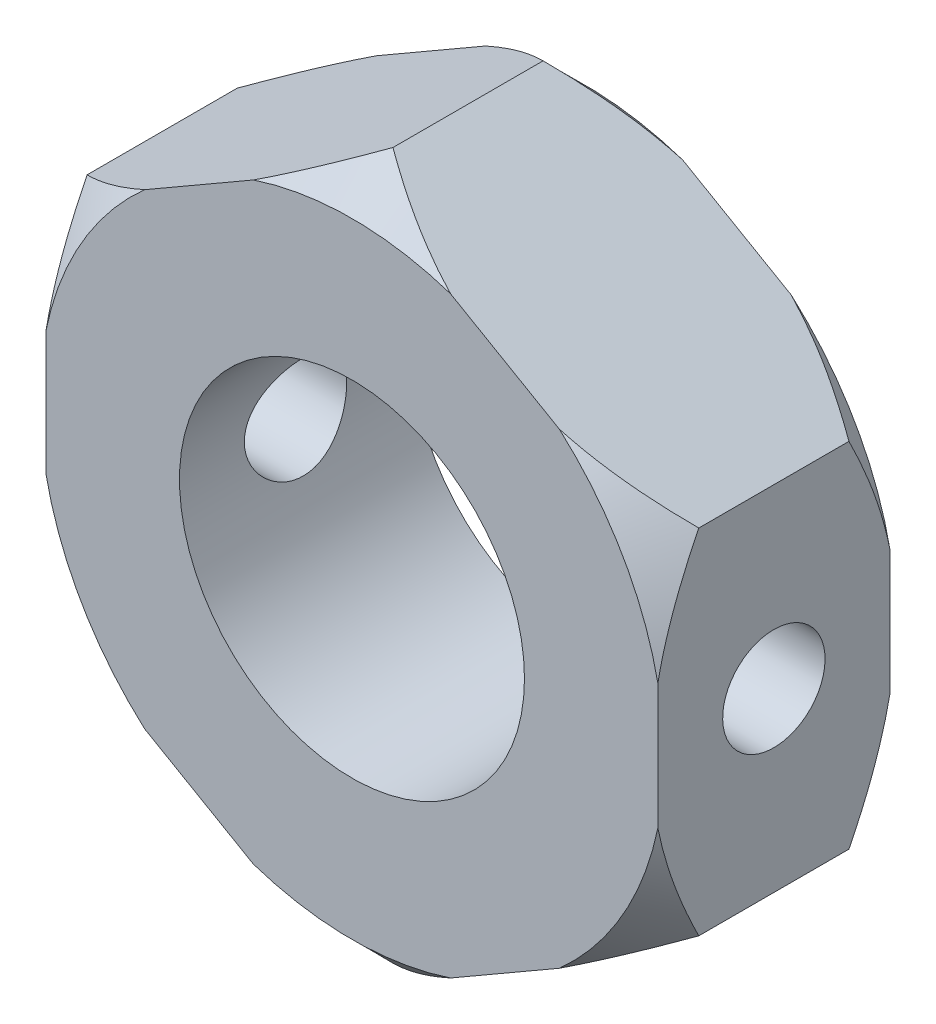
ISO-10303-21;
HEADER;
FILE_DESCRIPTION(('STEP AP214'),'2;1');
FILE_NAME('part.step','',(''),(''),'','','');
FILE_SCHEMA(('AUTOMOTIVE_DESIGN { 1 0 10303 214 1 1 1 1 }'));
ENDSEC;
DATA;
#1=APPLICATION_CONTEXT('core data for automotive mechanical design processes');
#2=APPLICATION_PROTOCOL_DEFINITION('international standard','automotive_design',2000,#1);
#3=PRODUCT_CONTEXT('',#1,'mechanical');
#4=PRODUCT('Part','Part','',(#3));
#5=PRODUCT_RELATED_PRODUCT_CATEGORY('part','',(#4));
#6=PRODUCT_DEFINITION_FORMATION('','',#4);
#7=PRODUCT_DEFINITION_CONTEXT('part definition',#1,'design');
#8=PRODUCT_DEFINITION('design','',#6,#7);
#9=PRODUCT_DEFINITION_SHAPE('','',#8);
#10=(LENGTH_UNIT() NAMED_UNIT(*) SI_UNIT(.MILLI.,.METRE.));
#11=(NAMED_UNIT(*) PLANE_ANGLE_UNIT() SI_UNIT($,.RADIAN.));
#12=(NAMED_UNIT(*) SI_UNIT($,.STERADIAN.) SOLID_ANGLE_UNIT());
#13=UNCERTAINTY_MEASURE_WITH_UNIT(LENGTH_MEASURE(1.E-05),#10,'distance_accuracy_value','');
#14=(GEOMETRIC_REPRESENTATION_CONTEXT(3) GLOBAL_UNCERTAINTY_ASSIGNED_CONTEXT((#13)) GLOBAL_UNIT_ASSIGNED_CONTEXT((#10,
#11,#12)) REPRESENTATION_CONTEXT('',''));
#15=CARTESIAN_POINT('',(0.,0.,0.));
#16=DIRECTION('',(0.,0.,1.));
#17=DIRECTION('',(1.,0.,0.));
#18=AXIS2_PLACEMENT_3D('',#15,#16,#17);
#19=CARTESIAN_POINT('',(0.,0.,1.20000000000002));
#20=DIRECTION('',(0.,0.,1.));
#21=DIRECTION('',(1.,0.,0.));
#22=AXIS2_PLACEMENT_3D('',#19,#20,#21);
#23=CONICAL_SURFACE('',#22,10.35,0.785398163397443);
#24=CARTESIAN_POINT('',(-6.07313481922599,6.843673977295,-0.00020000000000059));
#25=CARTESIAN_POINT('',(-6.32567043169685,6.69787247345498,0.0583173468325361));
#26=CARTESIAN_POINT('',(-6.57569625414,6.55351999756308,0.129733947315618));
#27=CARTESIAN_POINT('',(-7.06917763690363,6.26860838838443,0.294302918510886));
#28=CARTESIAN_POINT('',(-7.31265717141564,6.12803541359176,0.387358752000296));
#29=CARTESIAN_POINT('',(-7.79349721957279,5.85042228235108,0.591628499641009));
#30=CARTESIAN_POINT('',(-8.03086306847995,5.71337904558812,0.702825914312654));
#31=CARTESIAN_POINT('',(-8.38314234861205,5.50999050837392,0.881059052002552));
#32=CARTESIAN_POINT('',(-8.50020123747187,5.44240652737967,0.942528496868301));
#33=CARTESIAN_POINT('',(-8.73291454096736,5.30804943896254,1.06886197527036));
#34=CARTESIAN_POINT('',(-8.8485691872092,5.24127619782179,1.13372543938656));
#35=CARTESIAN_POINT('',(-8.9635629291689,5.17488452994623,1.2001154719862));
#36=B_SPLINE_CURVE_WITH_KNOTS('',3,(#24,#25,#26,#27,#28,#29,#30,#31,#32,#33,#34,#35),
.UNSPECIFIED.,.F.,.F.,(4,2,2,2,2,4),(0.,0.891515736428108,1.77912805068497,2.66593755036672,
3.1113637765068,3.55671551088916),.UNSPECIFIED.);
#37=CARTESIAN_POINT('',(-6.07399699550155,6.84317619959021,0.));
#38=VERTEX_POINT('',#37);
#39=CARTESIAN_POINT('',(-8.96336292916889,5.17500000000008,1.20000000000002));
#40=VERTEX_POINT('',#39);
#41=EDGE_CURVE('E309',#38,#40,#36,.T.);
#42=ORIENTED_EDGE('',*,*,#41,.F.);
#43=CARTESIAN_POINT('',(0.,0.,0.));
#44=DIRECTION('',(0.,0.,1.));
#45=DIRECTION('',(1.,0.,0.));
#46=AXIS2_PLACEMENT_3D('',#43,#44,#45);
#47=CIRCLE('',#46,9.14999999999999);
#48=CARTESIAN_POINT('',(-8.96336292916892,1.83864760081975,0.));
#49=VERTEX_POINT('',#48);
#50=EDGE_CURVE('E451',#49,#38,#47,.F.);
#51=ORIENTED_EDGE('',*,*,#50,.F.);
#52=CARTESIAN_POINT('',(-8.96336292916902,-10.8752887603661,4.9430401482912));
#53=CARTESIAN_POINT('',(-8.96336292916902,-10.6128352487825,4.74055592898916));
#54=CARTESIAN_POINT('',(-8.96336292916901,-10.3489762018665,4.53986504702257));
#55=CARTESIAN_POINT('',(-8.96336292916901,-9.81786949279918,4.14289176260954));
#56=CARTESIAN_POINT('',(-8.96336292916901,-9.5506210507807,3.94661040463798));
#57=CARTESIAN_POINT('',(-8.963362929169,-9.01020599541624,3.5578814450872));
#58=CARTESIAN_POINT('',(-8.963362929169,-8.73700964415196,3.36547505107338));
#59=CARTESIAN_POINT('',(-8.963362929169,-8.18608508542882,2.98728615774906));
#60=CARTESIAN_POINT('',(-8.96336292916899,-7.90835719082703,2.80150320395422));
#61=CARTESIAN_POINT('',(-8.96336292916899,-7.32954291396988,2.42637188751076));
#62=CARTESIAN_POINT('',(-8.96336292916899,-7.02810414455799,2.23756452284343));
#63=CARTESIAN_POINT('',(-8.96336292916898,-6.41814305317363,1.87156450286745));
#64=CARTESIAN_POINT('',(-8.96336292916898,-6.10961954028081,1.69437381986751));
#65=CARTESIAN_POINT('',(-8.96336292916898,-5.48538709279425,1.35537274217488));
#66=CARTESIAN_POINT('',(-8.96336292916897,-5.16970285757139,1.19351722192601));
#67=CARTESIAN_POINT('',(-8.96336292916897,-4.52936346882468,0.888813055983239));
#68=CARTESIAN_POINT('',(-8.96336292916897,-4.20471266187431,0.74595538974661));
#69=CARTESIAN_POINT('',(-8.96336292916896,-3.57909385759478,0.497692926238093));
#70=CARTESIAN_POINT('',(-8.96336292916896,-3.27905922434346,0.389959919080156));
#71=CARTESIAN_POINT('',(-8.96336292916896,-2.6712814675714,0.198503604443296));
#72=CARTESIAN_POINT('',(-8.96336292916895,-2.36353785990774,0.114781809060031));
#73=CARTESIAN_POINT('',(-8.96336292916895,-1.74757895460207,-0.0226981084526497));
#74=CARTESIAN_POINT('',(-8.96336292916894,-1.43948832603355,-0.0770053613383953));
#75=CARTESIAN_POINT('',(-8.96336292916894,-0.819396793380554,-0.154512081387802));
#76=CARTESIAN_POINT('',(-8.96336292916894,-0.507396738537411,-0.177718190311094));
#77=CARTESIAN_POINT('',(-8.96336292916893,0.103273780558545,-0.191006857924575));
#78=CARTESIAN_POINT('',(-8.96336292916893,0.401913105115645,-0.182531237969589));
#79=CARTESIAN_POINT('',(-8.96336292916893,0.996894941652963,-0.136251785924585));
#80=CARTESIAN_POINT('',(-8.96336292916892,1.29323724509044,-0.0984453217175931));
#81=CARTESIAN_POINT('',(-8.96336292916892,1.88650531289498,0.00498897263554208));
#82=CARTESIAN_POINT('',(-8.96336292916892,2.18334346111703,0.0711108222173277));
#83=CARTESIAN_POINT('',(-8.96336292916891,2.77047050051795,0.227485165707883));
#84=CARTESIAN_POINT('',(-8.96336292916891,3.06075973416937,0.317736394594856));
#85=CARTESIAN_POINT('',(-8.96336292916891,3.64931808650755,0.523643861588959));
#86=CARTESIAN_POINT('',(-8.9633629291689,3.9472022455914,0.640387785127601));
#87=CARTESIAN_POINT('',(-8.9633629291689,4.53531743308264,0.891925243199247));
#88=CARTESIAN_POINT('',(-8.96336292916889,4.82554495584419,1.02672687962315));
#89=CARTESIAN_POINT('',(-8.96336292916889,5.39971139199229,1.31118403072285));
#90=CARTESIAN_POINT('',(-8.96336292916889,5.68362751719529,1.46088516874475));
#91=CARTESIAN_POINT('',(-8.96336292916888,6.24495737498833,1.77184892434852));
#92=CARTESIAN_POINT('',(-8.96336292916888,6.52237209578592,1.93310976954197));
#93=CARTESIAN_POINT('',(-8.96336292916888,7.05799886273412,2.25675143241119));
#94=CARTESIAN_POINT('',(-8.96336292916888,7.31648298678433,2.41868434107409));
#95=CARTESIAN_POINT('',(-8.96336292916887,7.82900996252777,2.7494527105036));
#96=CARTESIAN_POINT('',(-8.96336292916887,8.08305247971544,2.91828868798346));
#97=CARTESIAN_POINT('',(-8.96336292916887,8.58523729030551,3.26026075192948));
#98=CARTESIAN_POINT('',(-8.96336292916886,8.83341055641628,3.43335151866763));
#99=CARTESIAN_POINT('',(-8.96336292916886,9.32635099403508,3.7841804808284));
#100=CARTESIAN_POINT('',(-8.96336292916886,9.57111908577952,3.96191738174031));
#101=CARTESIAN_POINT('',(-8.96336292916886,9.8144584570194,4.14155633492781));
#102=B_SPLINE_CURVE_WITH_KNOTS('',3,(#52,#53,#54,#55,#56,#57,#58,#59,#60,#61,#62,#63,#64,#65,
#66,#67,#68,#69,#70,#71,#72,#73,#74,#75,#76,#77,#78,#79,#80,#81,#82,#83,#84,#85,#86,#87,#88,#89,
#90,#91,#92,#93,#94,#95,#96,#97,#98,#99,#100,#101),.UNSPECIFIED.,.F.,.F.,(4,2,2,2,2,2,2,2,2,2,2,
2,2,2,2,2,2,2,2,2,2,2,2,2,4),(0.,0.994470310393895,1.98917374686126,2.99154366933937,
3.99384467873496,5.06069886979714,6.12773372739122,7.19152427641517,8.25480790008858,
9.21035647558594,10.1659652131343,11.1030585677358,12.0399517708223,12.9347374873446,
13.82960351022,14.7407626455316,15.6518740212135,16.6109720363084,17.5705018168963,
18.5330658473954,19.4954826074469,20.41040974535,21.3254054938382,22.2330664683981,
23.1404771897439),.UNSPECIFIED.);
#103=EDGE_CURVE('E323',#40,#49,#102,.F.);
#104=ORIENTED_EDGE('',*,*,#103,.F.);
#105=EDGE_LOOP('',(#42,#51,#104));
#106=FACE_BOUND('',#105,.T.);
#107=ADVANCED_FACE('F29',(#106),#23,.T.);
#108=CARTESIAN_POINT('',(0.,0.,6.8));
#109=DIRECTION('',(0.,0.,-1.));
#110=DIRECTION('',(-1.,0.,0.));
#111=AXIS2_PLACEMENT_3D('',#108,#109,#110);
#112=CONICAL_SURFACE('',#111,9.14999999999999,0.785398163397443);
#113=CARTESIAN_POINT('',(-2.8902281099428,8.68132602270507,6.8002));
#114=CARTESIAN_POINT('',(-2.63769249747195,8.82712752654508,6.74168265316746));
#115=CARTESIAN_POINT('',(-2.3876666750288,8.97148000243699,6.67026605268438));
#116=CARTESIAN_POINT('',(-1.89418529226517,9.25639161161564,6.50569708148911));
#117=CARTESIAN_POINT('',(-1.65070575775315,9.39696458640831,6.4126412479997));
#118=CARTESIAN_POINT('',(-1.169865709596,9.67457771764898,6.20837150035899));
#119=CARTESIAN_POINT('',(-0.932499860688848,9.81162095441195,6.09717408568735));
#120=CARTESIAN_POINT('',(-0.580220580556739,10.0150094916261,5.91894094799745));
#121=CARTESIAN_POINT('',(-0.463161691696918,10.0825934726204,5.8574715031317));
#122=CARTESIAN_POINT('',(-0.230448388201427,10.2169505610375,5.73113802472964));
#123=CARTESIAN_POINT('',(-0.114793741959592,10.2837238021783,5.66627456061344));
#124=CARTESIAN_POINT('',(0.000200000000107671,10.3501154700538,5.59988452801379));
#125=B_SPLINE_CURVE_WITH_KNOTS('',3,(#113,#114,#115,#116,#117,#118,#119,#120,#121,#122,#123,
#124),.UNSPECIFIED.,.F.,.F.,(4,2,2,2,2,4),(0.,0.89151573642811,1.77912805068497,
2.66593755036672,3.11136377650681,3.55671551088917),.UNSPECIFIED.);
#126=CARTESIAN_POINT('',(-2.88936593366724,8.68182380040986,6.8));
#127=VERTEX_POINT('',#126);
#128=CARTESIAN_POINT('',(1.07552855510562E-13,10.35,5.59999999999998));
#129=VERTEX_POINT('',#128);
#130=EDGE_CURVE('E171',#127,#129,#125,.T.);
#131=ORIENTED_EDGE('',*,*,#130,.F.);
#132=CARTESIAN_POINT('',(0.,0.,6.8));
#133=DIRECTION('',(0.,0.,1.));
#134=DIRECTION('',(1.,0.,0.));
#135=AXIS2_PLACEMENT_3D('',#132,#133,#134);
#136=CIRCLE('',#135,9.14999999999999);
#137=CARTESIAN_POINT('',(2.88936593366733,8.68182380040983,6.8));
#138=VERTEX_POINT('',#137);
#139=EDGE_CURVE('E179',#138,#127,#136,.T.);
#140=ORIENTED_EDGE('',*,*,#139,.F.);
#141=CARTESIAN_POINT('',(-0.000200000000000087,10.3501154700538,5.5998845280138));
#142=CARTESIAN_POINT('',(0.114793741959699,10.2837238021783,5.66627456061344));
#143=CARTESIAN_POINT('',(0.230448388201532,10.2169505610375,5.73113802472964));
#144=CARTESIAN_POINT('',(0.463161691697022,10.0825934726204,5.8574715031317));
#145=CARTESIAN_POINT('',(0.580220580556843,10.0150094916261,5.91894094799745));
#146=CARTESIAN_POINT('',(0.93249986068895,9.81162095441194,6.09717408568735));
#147=CARTESIAN_POINT('',(1.1698657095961,9.67457771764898,6.20837150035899));
#148=CARTESIAN_POINT('',(1.65070575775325,9.3969645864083,6.4126412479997));
#149=CARTESIAN_POINT('',(1.89418529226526,9.25639161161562,6.50569708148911));
#150=CARTESIAN_POINT('',(2.38766667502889,8.97148000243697,6.67026605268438));
#151=CARTESIAN_POINT('',(2.63769249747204,8.82712752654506,6.74168265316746));
#152=CARTESIAN_POINT('',(2.89022810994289,8.68132602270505,6.8002));
#153=B_SPLINE_CURVE_WITH_KNOTS('',3,(#141,#142,#143,#144,#145,#146,#147,#148,#149,#150,#151,
#152),.UNSPECIFIED.,.F.,.F.,(4,2,2,2,2,4),(0.,0.445351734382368,0.890777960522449,
1.7775874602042,2.66519977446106,3.55671551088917),.UNSPECIFIED.);
#154=EDGE_CURVE('E214',#129,#138,#153,.T.);
#155=ORIENTED_EDGE('',*,*,#154,.F.);
#156=EDGE_LOOP('',(#131,#140,#155));
#157=FACE_BOUND('',#156,.T.);
#158=ADVANCED_FACE('F232',(#157),#112,.T.);
#159=CARTESIAN_POINT('',(-8.96336292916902,-10.8752887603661,1.85695985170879));
#160=CARTESIAN_POINT('',(-8.96336292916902,-10.6128352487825,2.05944407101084));
#161=CARTESIAN_POINT('',(-8.96336292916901,-10.3489762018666,2.26013495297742));
#162=CARTESIAN_POINT('',(-8.96336292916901,-9.81786949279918,2.65710823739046));
#163=CARTESIAN_POINT('',(-8.96336292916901,-9.55062105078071,2.85338959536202));
#164=CARTESIAN_POINT('',(-8.963362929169,-9.01020599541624,3.2421185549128));
#165=CARTESIAN_POINT('',(-8.963362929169,-8.73700964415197,3.43452494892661));
#166=CARTESIAN_POINT('',(-8.963362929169,-8.18608508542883,3.81271384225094));
#167=CARTESIAN_POINT('',(-8.96336292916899,-7.90835719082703,3.99849679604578));
#168=CARTESIAN_POINT('',(-8.96336292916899,-7.32954291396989,4.37362811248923));
#169=CARTESIAN_POINT('',(-8.96336292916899,-7.028104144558,4.56243547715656));
#170=CARTESIAN_POINT('',(-8.96336292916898,-6.41814305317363,4.92843549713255));
#171=CARTESIAN_POINT('',(-8.96336292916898,-6.10961954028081,5.10562618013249));
#172=CARTESIAN_POINT('',(-8.96336292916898,-5.48538709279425,5.44462725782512));
#173=CARTESIAN_POINT('',(-8.96336292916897,-5.1697028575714,5.60648277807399));
#174=CARTESIAN_POINT('',(-8.96336292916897,-4.52936346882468,5.91118694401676));
#175=CARTESIAN_POINT('',(-8.96336292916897,-4.20471266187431,6.05404461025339));
#176=CARTESIAN_POINT('',(-8.96336292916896,-3.57909385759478,6.3023070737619));
#177=CARTESIAN_POINT('',(-8.96336292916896,-3.27905922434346,6.41004008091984));
#178=CARTESIAN_POINT('',(-8.96336292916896,-2.67128146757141,6.6014963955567));
#179=CARTESIAN_POINT('',(-8.96336292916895,-2.36353785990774,6.68521819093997));
#180=CARTESIAN_POINT('',(-8.96336292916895,-1.74757895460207,6.82269810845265));
#181=CARTESIAN_POINT('',(-8.96336292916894,-1.43948832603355,6.8770053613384));
#182=CARTESIAN_POINT('',(-8.96336292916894,-0.819396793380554,6.9545120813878));
#183=CARTESIAN_POINT('',(-8.96336292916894,-0.507396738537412,6.97771819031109));
#184=CARTESIAN_POINT('',(-8.96336292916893,0.103273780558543,6.99100685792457));
#185=CARTESIAN_POINT('',(-8.96336292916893,0.401913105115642,6.98253123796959));
#186=CARTESIAN_POINT('',(-8.96336292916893,0.996894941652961,6.93625178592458));
#187=CARTESIAN_POINT('',(-8.96336292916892,1.29323724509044,6.89844532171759));
#188=CARTESIAN_POINT('',(-8.96336292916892,1.88650531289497,6.79501102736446));
#189=CARTESIAN_POINT('',(-8.96336292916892,2.18334346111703,6.72888917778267));
#190=CARTESIAN_POINT('',(-8.96336292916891,2.77047050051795,6.57251483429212));
#191=CARTESIAN_POINT('',(-8.96336292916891,3.06075973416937,6.48226360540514));
#192=CARTESIAN_POINT('',(-8.96336292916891,3.64931808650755,6.27635613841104));
#193=CARTESIAN_POINT('',(-8.9633629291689,3.9472022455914,6.1596122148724));
#194=CARTESIAN_POINT('',(-8.9633629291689,4.53531743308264,5.90807475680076));
#195=CARTESIAN_POINT('',(-8.96336292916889,4.82554495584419,5.77327312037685));
#196=CARTESIAN_POINT('',(-8.96336292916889,5.39971139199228,5.48881596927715));
#197=CARTESIAN_POINT('',(-8.96336292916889,5.68362751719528,5.33911483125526));
#198=CARTESIAN_POINT('',(-8.96336292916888,6.24495737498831,5.02815107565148));
#199=CARTESIAN_POINT('',(-8.96336292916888,6.52237209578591,4.86689023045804));
#200=CARTESIAN_POINT('',(-8.96336292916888,7.05799886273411,4.54324856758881));
#201=CARTESIAN_POINT('',(-8.96336292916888,7.31648298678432,4.38131565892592));
#202=CARTESIAN_POINT('',(-8.96336292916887,7.82900996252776,4.05054728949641));
#203=CARTESIAN_POINT('',(-8.96336292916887,8.08305247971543,3.88171131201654));
#204=CARTESIAN_POINT('',(-8.96336292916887,8.58523729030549,3.53973924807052));
#205=CARTESIAN_POINT('',(-8.96336292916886,8.83341055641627,3.36664848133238));
#206=CARTESIAN_POINT('',(-8.96336292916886,9.32635099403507,3.01581951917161));
#207=CARTESIAN_POINT('',(-8.96336292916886,9.57111908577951,2.83808261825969));
#208=CARTESIAN_POINT('',(-8.96336292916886,9.81445845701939,2.6584436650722));
#209=B_SPLINE_CURVE_WITH_KNOTS('',3,(#159,#160,#161,#162,#163,#164,#165,#166,#167,#168,#169,
#170,#171,#172,#173,#174,#175,#176,#177,#178,#179,#180,#181,#182,#183,#184,#185,#186,#187,#188,
#189,#190,#191,#192,#193,#194,#195,#196,#197,#198,#199,#200,#201,#202,#203,#204,#205,#206,#207,
#208),.UNSPECIFIED.,.F.,.F.,(4,2,2,2,2,2,2,2,2,2,2,2,2,2,2,2,2,2,2,2,2,2,2,2,4),(0.,
0.994470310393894,1.98917374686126,2.99154366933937,3.99384467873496,5.06069886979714,
6.12773372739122,7.19152427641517,8.25480790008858,9.21035647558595,10.1659652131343,
11.1030585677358,12.0399517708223,12.9347374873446,13.82960351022,14.7407626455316,
15.6518740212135,16.6109720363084,17.5705018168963,18.5330658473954,19.4954826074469,
20.4104097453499,21.3254054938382,22.2330664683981,23.1404771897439),.UNSPECIFIED.);
#210=CARTESIAN_POINT('',(-8.96336292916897,-5.17499999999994,5.59999999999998));
#211=VERTEX_POINT('',#210);
#212=CARTESIAN_POINT('',(-8.96336292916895,-1.83864760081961,6.8));
#213=VERTEX_POINT('',#212);
#214=EDGE_CURVE('E328',#211,#213,#209,.T.);
#215=ORIENTED_EDGE('',*,*,#214,.F.);
#216=CARTESIAN_POINT('',(-6.0731348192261,-6.8436739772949,6.8002));
#217=CARTESIAN_POINT('',(-6.32567043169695,-6.69787247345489,6.74168265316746));
#218=CARTESIAN_POINT('',(-6.5756962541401,-6.55351999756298,6.67026605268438));
#219=CARTESIAN_POINT('',(-7.06917763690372,-6.26860838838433,6.50569708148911));
#220=CARTESIAN_POINT('',(-7.31265717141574,-6.12803541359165,6.4126412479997));
#221=CARTESIAN_POINT('',(-7.79349721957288,-5.85042228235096,6.20837150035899));
#222=CARTESIAN_POINT('',(-8.03086306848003,-5.71337904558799,6.09717408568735));
#223=CARTESIAN_POINT('',(-8.38314234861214,-5.50999050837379,5.91894094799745));
#224=CARTESIAN_POINT('',(-8.50020123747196,-5.44240652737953,5.8574715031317));
#225=CARTESIAN_POINT('',(-8.73291454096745,-5.3080494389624,5.73113802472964));
#226=CARTESIAN_POINT('',(-8.84856918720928,-5.24127619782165,5.66627456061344));
#227=CARTESIAN_POINT('',(-8.96356292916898,-5.17488452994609,5.59988452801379));
#228=B_SPLINE_CURVE_WITH_KNOTS('',3,(#216,#217,#218,#219,#220,#221,#222,#223,#224,#225,#226,
#227),.UNSPECIFIED.,.F.,.F.,(4,2,2,2,2,4),(0.,0.891515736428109,1.77912805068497,
2.66593755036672,3.1113637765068,3.55671551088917),.UNSPECIFIED.);
#229=CARTESIAN_POINT('',(-6.07399699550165,-6.84317619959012,6.8));
#230=VERTEX_POINT('',#229);
#231=EDGE_CURVE('E272',#230,#211,#228,.T.);
#232=ORIENTED_EDGE('',*,*,#231,.F.);
#233=EDGE_CURVE('E184',#213,#230,#136,.T.);
#234=ORIENTED_EDGE('',*,*,#233,.F.);
#235=EDGE_LOOP('',(#215,#232,#234));
#236=FACE_BOUND('',#235,.T.);
#237=ADVANCED_FACE('F404',(#236),#112,.T.);
#238=CARTESIAN_POINT('',(0.000200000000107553,10.3501154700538,1.2001154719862));
#239=CARTESIAN_POINT('',(-0.114793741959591,10.2837238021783,1.13372543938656));
#240=CARTESIAN_POINT('',(-0.230448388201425,10.2169505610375,1.06886197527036));
#241=CARTESIAN_POINT('',(-0.463161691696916,10.0825934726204,0.942528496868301));
#242=CARTESIAN_POINT('',(-0.580220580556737,10.0150094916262,0.881059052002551));
#243=CARTESIAN_POINT('',(-0.932499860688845,9.81162095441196,0.702825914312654));
#244=CARTESIAN_POINT('',(-1.169865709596,9.67457771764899,0.59162849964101));
#245=CARTESIAN_POINT('',(-1.65070575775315,9.39696458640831,0.387358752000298));
#246=CARTESIAN_POINT('',(-1.89418529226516,9.25639161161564,0.294302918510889));
#247=CARTESIAN_POINT('',(-2.38766667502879,8.971480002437,0.129733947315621));
#248=CARTESIAN_POINT('',(-2.63769249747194,8.82712752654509,0.0583173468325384));
#249=CARTESIAN_POINT('',(-2.89022810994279,8.68132602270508,-0.000199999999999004));
#250=B_SPLINE_CURVE_WITH_KNOTS('',3,(#238,#239,#240,#241,#242,#243,#244,#245,#246,#247,#248,
#249),.UNSPECIFIED.,.F.,.F.,(4,2,2,2,2,4),(0.,0.445351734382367,0.890777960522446,
1.77758746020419,2.66519977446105,3.55671551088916),.UNSPECIFIED.);
#251=CARTESIAN_POINT('',(1.07552855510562E-13,10.35,1.19999999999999));
#252=VERTEX_POINT('',#251);
#253=CARTESIAN_POINT('',(-2.88936593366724,8.68182380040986,0.));
#254=VERTEX_POINT('',#253);
#255=EDGE_CURVE('E305',#252,#254,#250,.T.);
#256=ORIENTED_EDGE('',*,*,#255,.F.);
#257=CARTESIAN_POINT('',(2.89022810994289,8.68132602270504,-0.00020000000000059));
#258=CARTESIAN_POINT('',(2.63769249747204,8.82712752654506,0.0583173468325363));
#259=CARTESIAN_POINT('',(2.38766667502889,8.97148000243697,0.129733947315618));
#260=CARTESIAN_POINT('',(1.89418529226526,9.25639161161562,0.294302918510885));
#261=CARTESIAN_POINT('',(1.65070575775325,9.39696458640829,0.387358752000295));
#262=CARTESIAN_POINT('',(1.1698657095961,9.67457771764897,0.591628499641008));
#263=CARTESIAN_POINT('',(0.932499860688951,9.81162095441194,0.702825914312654));
#264=CARTESIAN_POINT('',(0.580220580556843,10.0150094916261,0.881059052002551));
#265=CARTESIAN_POINT('',(0.463161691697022,10.0825934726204,0.9425284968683));
#266=CARTESIAN_POINT('',(0.230448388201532,10.2169505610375,1.06886197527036));
#267=CARTESIAN_POINT('',(0.114793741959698,10.2837238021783,1.13372543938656));
#268=CARTESIAN_POINT('',(-0.000200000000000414,10.3501154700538,1.20011547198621));
#269=B_SPLINE_CURVE_WITH_KNOTS('',3,(#257,#258,#259,#260,#261,#262,#263,#264,#265,#266,#267,
#268),.UNSPECIFIED.,.F.,.F.,(4,2,2,2,2,4),(0.,0.891515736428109,1.77912805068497,
2.66593755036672,3.1113637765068,3.55671551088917),.UNSPECIFIED.);
#270=CARTESIAN_POINT('',(2.88936593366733,8.68182380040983,0.));
#271=VERTEX_POINT('',#270);
#272=EDGE_CURVE('E11',#271,#252,#269,.T.);
#273=ORIENTED_EDGE('',*,*,#272,.F.);
#274=EDGE_CURVE('E186',#254,#271,#47,.F.);
#275=ORIENTED_EDGE('',*,*,#274,.F.);
#276=EDGE_LOOP('',(#256,#273,#275));
#277=FACE_BOUND('',#276,.T.);
#278=ADVANCED_FACE('F409',(#277),#23,.T.);
#279=CARTESIAN_POINT('',(-8.9635629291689,5.17488452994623,5.5998845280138));
#280=CARTESIAN_POINT('',(-8.8485691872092,5.24127619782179,5.66627456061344));
#281=CARTESIAN_POINT('',(-8.73291454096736,5.30804943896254,5.73113802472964));
#282=CARTESIAN_POINT('',(-8.50020123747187,5.44240652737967,5.8574715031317));
#283=CARTESIAN_POINT('',(-8.38314234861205,5.50999050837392,5.91894094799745));
#284=CARTESIAN_POINT('',(-8.03086306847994,5.71337904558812,6.09717408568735));
#285=CARTESIAN_POINT('',(-7.79349721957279,5.85042228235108,6.20837150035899));
#286=CARTESIAN_POINT('',(-7.31265717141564,6.12803541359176,6.41264124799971));
#287=CARTESIAN_POINT('',(-7.06917763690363,6.26860838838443,6.50569708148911));
#288=CARTESIAN_POINT('',(-6.57569625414,6.55351999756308,6.67026605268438));
#289=CARTESIAN_POINT('',(-6.32567043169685,6.69787247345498,6.74168265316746));
#290=CARTESIAN_POINT('',(-6.07313481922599,6.843673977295,6.8002));
#291=B_SPLINE_CURVE_WITH_KNOTS('',3,(#279,#280,#281,#282,#283,#284,#285,#286,#287,#288,#289,
#290),.UNSPECIFIED.,.F.,.F.,(4,2,2,2,2,4),(0.,0.445351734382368,0.890777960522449,
1.7775874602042,2.66519977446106,3.55671551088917),.UNSPECIFIED.);
#292=CARTESIAN_POINT('',(-8.9633629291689,5.17500000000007,5.59999999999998));
#293=VERTEX_POINT('',#292);
#294=CARTESIAN_POINT('',(-6.07399699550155,6.84317619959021,6.8));
#295=VERTEX_POINT('',#294);
#296=EDGE_CURVE('E160',#293,#295,#291,.T.);
#297=ORIENTED_EDGE('',*,*,#296,.F.);
#298=CARTESIAN_POINT('',(-8.96336292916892,1.83864760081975,6.8));
#299=VERTEX_POINT('',#298);
#300=EDGE_CURVE('E183',#299,#293,#209,.T.);
#301=ORIENTED_EDGE('',*,*,#300,.F.);
#302=EDGE_CURVE('E176',#295,#299,#136,.T.);
#303=ORIENTED_EDGE('',*,*,#302,.F.);
#304=EDGE_LOOP('',(#297,#301,#303));
#305=FACE_BOUND('',#304,.T.);
#306=ADVANCED_FACE('F182',(#305),#112,.T.);
#307=CARTESIAN_POINT('',(-2.89022810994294,-8.68132602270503,-0.000200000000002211));
#308=CARTESIAN_POINT('',(-2.63769249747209,-8.82712752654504,0.0583173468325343));
#309=CARTESIAN_POINT('',(-2.38766667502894,-8.97148000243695,0.129733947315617));
#310=CARTESIAN_POINT('',(-1.89418529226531,-9.25639161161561,0.294302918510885));
#311=CARTESIAN_POINT('',(-1.6507057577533,-9.39696458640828,0.387358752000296));
#312=CARTESIAN_POINT('',(-1.16986570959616,-9.67457771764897,0.591628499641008));
#313=CARTESIAN_POINT('',(-0.932499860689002,-9.81162095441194,0.702825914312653));
#314=CARTESIAN_POINT('',(-0.580220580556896,-10.0150094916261,0.881059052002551));
#315=CARTESIAN_POINT('',(-0.463161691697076,-10.0825934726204,0.942528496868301));
#316=CARTESIAN_POINT('',(-0.230448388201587,-10.2169505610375,1.06886197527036));
#317=CARTESIAN_POINT('',(-0.114793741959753,-10.2837238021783,1.13372543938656));
#318=CARTESIAN_POINT('',(0.000199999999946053,-10.3501154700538,1.20011547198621));
#319=B_SPLINE_CURVE_WITH_KNOTS('',3,(#307,#308,#309,#310,#311,#312,#313,#314,#315,#316,#317,
#318),.UNSPECIFIED.,.F.,.F.,(4,2,2,2,2,4),(0.,0.891515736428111,1.77912805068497,
2.66593755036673,3.11136377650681,3.55671551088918),.UNSPECIFIED.);
#320=CARTESIAN_POINT('',(-2.88936593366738,-8.68182380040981,0.));
#321=VERTEX_POINT('',#320);
#322=CARTESIAN_POINT('',(0.,-10.35,1.20000000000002));
#323=VERTEX_POINT('',#322);
#324=EDGE_CURVE('E346',#321,#323,#319,.T.);
#325=ORIENTED_EDGE('',*,*,#324,.F.);
#326=CARTESIAN_POINT('',(2.88936593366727,-8.68182380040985,0.));
#327=VERTEX_POINT('',#326);
#328=EDGE_CURVE('E449',#327,#321,#47,.F.);
#329=ORIENTED_EDGE('',*,*,#328,.F.);
#330=CARTESIAN_POINT('',(-0.000200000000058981,-10.3501154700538,1.2001154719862));
#331=CARTESIAN_POINT('',(0.11479374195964,-10.2837238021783,1.13372543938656));
#332=CARTESIAN_POINT('',(0.230448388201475,-10.2169505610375,1.06886197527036));
#333=CARTESIAN_POINT('',(0.463161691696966,-10.0825934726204,0.942528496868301));
#334=CARTESIAN_POINT('',(0.580220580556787,-10.0150094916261,0.881059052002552));
#335=CARTESIAN_POINT('',(0.932499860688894,-9.81162095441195,0.702825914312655));
#336=CARTESIAN_POINT('',(1.16986570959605,-9.67457771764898,0.591628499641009));
#337=CARTESIAN_POINT('',(1.65070575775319,-9.3969645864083,0.387358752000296));
#338=CARTESIAN_POINT('',(1.89418529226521,-9.25639161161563,0.294302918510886));
#339=CARTESIAN_POINT('',(2.38766667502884,-8.97148000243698,0.129733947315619));
#340=CARTESIAN_POINT('',(2.63769249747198,-8.82712752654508,0.0583173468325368));
#341=CARTESIAN_POINT('',(2.89022810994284,-8.68132602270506,-0.000200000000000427));
#342=B_SPLINE_CURVE_WITH_KNOTS('',3,(#330,#331,#332,#333,#334,#335,#336,#337,#338,#339,#340,
#341),.UNSPECIFIED.,.F.,.F.,(4,2,2,2,2,4),(0.,0.445351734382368,0.890777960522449,
1.7775874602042,2.66519977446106,3.55671551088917),.UNSPECIFIED.);
#343=EDGE_CURVE('E365',#323,#327,#342,.T.);
#344=ORIENTED_EDGE('',*,*,#343,.F.);
#345=EDGE_LOOP('',(#325,#329,#344));
#346=FACE_BOUND('',#345,.T.);
#347=ADVANCED_FACE('F417',(#346),#23,.T.);
#348=CARTESIAN_POINT('',(6.07313481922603,-6.84367397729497,-0.000200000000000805));
#349=CARTESIAN_POINT('',(6.32567043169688,-6.69787247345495,0.0583173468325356));
#350=CARTESIAN_POINT('',(6.57569625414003,-6.55351999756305,0.129733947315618));
#351=CARTESIAN_POINT('',(7.06917763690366,-6.2686083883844,0.294302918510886));
#352=CARTESIAN_POINT('',(7.31265717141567,-6.12803541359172,0.387358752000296));
#353=CARTESIAN_POINT('',(7.79349721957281,-5.85042228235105,0.591628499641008));
#354=CARTESIAN_POINT('',(8.03086306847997,-5.71337904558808,0.702825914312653));
#355=CARTESIAN_POINT('',(8.38314234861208,-5.50999050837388,0.88105905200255));
#356=CARTESIAN_POINT('',(8.5002012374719,-5.44240652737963,0.9425284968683));
#357=CARTESIAN_POINT('',(8.73291454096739,-5.3080494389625,1.06886197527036));
#358=CARTESIAN_POINT('',(8.84856918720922,-5.24127619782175,1.13372543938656));
#359=CARTESIAN_POINT('',(8.96356292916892,-5.17488452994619,1.2001154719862));
#360=B_SPLINE_CURVE_WITH_KNOTS('',3,(#348,#349,#350,#351,#352,#353,#354,#355,#356,#357,#358,
#359),.UNSPECIFIED.,.F.,.F.,(4,2,2,2,2,4),(0.,0.891515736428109,1.77912805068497,
2.66593755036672,3.1113637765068,3.55671551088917),.UNSPECIFIED.);
#361=CARTESIAN_POINT('',(6.0739969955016,-6.84317619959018,0.));
#362=VERTEX_POINT('',#361);
#363=CARTESIAN_POINT('',(8.96336292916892,-5.17500000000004,1.20000000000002));
#364=VERTEX_POINT('',#363);
#365=EDGE_CURVE('E369',#362,#364,#360,.T.);
#366=ORIENTED_EDGE('',*,*,#365,.F.);
#367=CARTESIAN_POINT('',(8.96336292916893,-1.83864760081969,0.));
#368=VERTEX_POINT('',#367);
#369=EDGE_CURVE('E194',#368,#362,#47,.F.);
#370=ORIENTED_EDGE('',*,*,#369,.F.);
#371=CARTESIAN_POINT('',(8.9633629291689,-10.8752887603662,4.94304014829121));
#372=CARTESIAN_POINT('',(8.96336292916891,-10.6128352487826,4.74055592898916));
#373=CARTESIAN_POINT('',(8.96336292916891,-10.3489762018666,4.53986504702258));
#374=CARTESIAN_POINT('',(8.96336292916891,-9.81786949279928,4.14289176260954));
#375=CARTESIAN_POINT('',(8.96336292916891,-9.5506210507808,3.94661040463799));
#376=CARTESIAN_POINT('',(8.96336292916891,-9.01020599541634,3.5578814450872));
#377=CARTESIAN_POINT('',(8.96336292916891,-8.73700964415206,3.36547505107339));
#378=CARTESIAN_POINT('',(8.96336292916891,-8.18608508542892,2.98728615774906));
#379=CARTESIAN_POINT('',(8.96336292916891,-7.90835719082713,2.80150320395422));
#380=CARTESIAN_POINT('',(8.96336292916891,-7.32954291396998,2.42637188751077));
#381=CARTESIAN_POINT('',(8.96336292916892,-7.02810414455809,2.23756452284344));
#382=CARTESIAN_POINT('',(8.96336292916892,-6.41814305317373,1.87156450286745));
#383=CARTESIAN_POINT('',(8.96336292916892,-6.10961954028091,1.69437381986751));
#384=CARTESIAN_POINT('',(8.96336292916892,-5.48538709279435,1.35537274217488));
#385=CARTESIAN_POINT('',(8.96336292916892,-5.16970285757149,1.19351722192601));
#386=CARTESIAN_POINT('',(8.96336292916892,-4.52936346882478,0.888813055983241));
#387=CARTESIAN_POINT('',(8.96336292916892,-4.20471266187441,0.745955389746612));
#388=CARTESIAN_POINT('',(8.96336292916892,-3.57909385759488,0.497692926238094));
#389=CARTESIAN_POINT('',(8.96336292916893,-3.27905922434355,0.389959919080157));
#390=CARTESIAN_POINT('',(8.96336292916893,-2.6712814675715,0.198503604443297));
#391=CARTESIAN_POINT('',(8.96336292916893,-2.36353785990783,0.114781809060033));
#392=CARTESIAN_POINT('',(8.96336292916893,-1.74757895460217,-0.0226981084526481));
#393=CARTESIAN_POINT('',(8.96336292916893,-1.43948832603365,-0.0770053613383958));
#394=CARTESIAN_POINT('',(8.96336292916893,-0.819396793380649,-0.154512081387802));
#395=CARTESIAN_POINT('',(8.96336292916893,-0.507396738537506,-0.177718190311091));
#396=CARTESIAN_POINT('',(8.96336292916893,0.10327378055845,-0.191006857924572));
#397=CARTESIAN_POINT('',(8.96336292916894,0.401913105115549,-0.182531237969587));
#398=CARTESIAN_POINT('',(8.96336292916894,0.996894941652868,-0.136251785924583));
#399=CARTESIAN_POINT('',(8.96336292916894,1.29323724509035,-0.0984453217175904));
#400=CARTESIAN_POINT('',(8.96336292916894,1.88650531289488,0.00498897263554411));
#401=CARTESIAN_POINT('',(8.96336292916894,2.18334346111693,0.0711108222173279));
#402=CARTESIAN_POINT('',(8.96336292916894,2.77047050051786,0.227485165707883));
#403=CARTESIAN_POINT('',(8.96336292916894,3.06075973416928,0.317736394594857));
#404=CARTESIAN_POINT('',(8.96336292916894,3.64931808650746,0.523643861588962));
#405=CARTESIAN_POINT('',(8.96336292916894,3.94720224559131,0.640387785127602));
#406=CARTESIAN_POINT('',(8.96336292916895,4.53531743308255,0.891925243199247));
#407=CARTESIAN_POINT('',(8.96336292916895,4.8255449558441,1.02672687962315));
#408=CARTESIAN_POINT('',(8.96336292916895,5.39971139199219,1.31118403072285));
#409=CARTESIAN_POINT('',(8.96336292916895,5.68362751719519,1.46088516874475));
#410=CARTESIAN_POINT('',(8.96336292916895,6.24495737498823,1.77184892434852));
#411=CARTESIAN_POINT('',(8.96336292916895,6.52237209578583,1.93310976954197));
#412=CARTESIAN_POINT('',(8.96336292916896,7.05799886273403,2.25675143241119));
#413=CARTESIAN_POINT('',(8.96336292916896,7.31648298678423,2.41868434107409));
#414=CARTESIAN_POINT('',(8.96336292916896,7.82900996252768,2.7494527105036));
#415=CARTESIAN_POINT('',(8.96336292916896,8.08305247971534,2.91828868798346));
#416=CARTESIAN_POINT('',(8.96336292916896,8.58523729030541,3.26026075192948));
#417=CARTESIAN_POINT('',(8.96336292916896,8.83341055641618,3.43335151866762));
#418=CARTESIAN_POINT('',(8.96336292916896,9.32635099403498,3.7841804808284));
#419=CARTESIAN_POINT('',(8.96336292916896,9.57111908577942,3.96191738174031));
#420=CARTESIAN_POINT('',(8.96336292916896,9.8144584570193,4.14155633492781));
#421=B_SPLINE_CURVE_WITH_KNOTS('',3,(#371,#372,#373,#374,#375,#376,#377,#378,#379,#380,#381,
#382,#383,#384,#385,#386,#387,#388,#389,#390,#391,#392,#393,#394,#395,#396,#397,#398,#399,#400,
#401,#402,#403,#404,#405,#406,#407,#408,#409,#410,#411,#412,#413,#414,#415,#416,#417,#418,#419,
#420),.UNSPECIFIED.,.F.,.F.,(4,2,2,2,2,2,2,2,2,2,2,2,2,2,2,2,2,2,2,2,2,2,2,2,4),(0.,
0.994470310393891,1.98917374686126,2.99154366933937,3.99384467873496,5.06069886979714,
6.12773372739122,7.19152427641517,8.25480790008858,9.21035647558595,10.1659652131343,
11.1030585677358,12.0399517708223,12.9347374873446,13.82960351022,14.7407626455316,
15.6518740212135,16.6109720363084,17.5705018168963,18.5330658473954,19.4954826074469,
20.41040974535,21.3254054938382,22.2330664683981,23.1404771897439),.UNSPECIFIED.);
#422=EDGE_CURVE('E384',#364,#368,#421,.T.);
#423=ORIENTED_EDGE('',*,*,#422,.F.);
#424=EDGE_LOOP('',(#366,#370,#423));
#425=FACE_BOUND('',#424,.T.);
#426=ADVANCED_FACE('F425',(#425),#23,.T.);
#427=CARTESIAN_POINT('',(0.000199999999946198,-10.3501154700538,5.5998845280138));
#428=CARTESIAN_POINT('',(-0.114793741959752,-10.2837238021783,5.66627456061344));
#429=CARTESIAN_POINT('',(-0.230448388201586,-10.2169505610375,5.73113802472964));
#430=CARTESIAN_POINT('',(-0.463161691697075,-10.0825934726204,5.8574715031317));
#431=CARTESIAN_POINT('',(-0.580220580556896,-10.0150094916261,5.91894094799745));
#432=CARTESIAN_POINT('',(-0.932499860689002,-9.81162095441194,6.09717408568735));
#433=CARTESIAN_POINT('',(-1.16986570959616,-9.67457771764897,6.20837150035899));
#434=CARTESIAN_POINT('',(-1.6507057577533,-9.39696458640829,6.4126412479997));
#435=CARTESIAN_POINT('',(-1.89418529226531,-9.25639161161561,6.50569708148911));
#436=CARTESIAN_POINT('',(-2.38766667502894,-8.97148000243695,6.67026605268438));
#437=CARTESIAN_POINT('',(-2.63769249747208,-8.82712752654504,6.74168265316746));
#438=CARTESIAN_POINT('',(-2.89022810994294,-8.68132602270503,6.8002));
#439=B_SPLINE_CURVE_WITH_KNOTS('',3,(#427,#428,#429,#430,#431,#432,#433,#434,#435,#436,#437,
#438),.UNSPECIFIED.,.F.,.F.,(4,2,2,2,2,4),(0.,0.445351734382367,0.89077796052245,
1.7775874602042,2.66519977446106,3.55671551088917),.UNSPECIFIED.);
#440=CARTESIAN_POINT('',(0.,-10.35,5.59999999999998));
#441=VERTEX_POINT('',#440);
#442=CARTESIAN_POINT('',(-2.88936593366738,-8.68182380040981,6.8));
#443=VERTEX_POINT('',#442);
#444=EDGE_CURVE('E264',#441,#443,#439,.T.);
#445=ORIENTED_EDGE('',*,*,#444,.F.);
#446=CARTESIAN_POINT('',(2.89022810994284,-8.68132602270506,6.8002));
#447=CARTESIAN_POINT('',(2.63769249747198,-8.82712752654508,6.74168265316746));
#448=CARTESIAN_POINT('',(2.38766667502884,-8.97148000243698,6.67026605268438));
#449=CARTESIAN_POINT('',(1.89418529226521,-9.25639161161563,6.50569708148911));
#450=CARTESIAN_POINT('',(1.65070575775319,-9.3969645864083,6.4126412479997));
#451=CARTESIAN_POINT('',(1.16986570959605,-9.67457771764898,6.20837150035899));
#452=CARTESIAN_POINT('',(0.932499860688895,-9.81162095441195,6.09717408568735));
#453=CARTESIAN_POINT('',(0.580220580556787,-10.0150094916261,5.91894094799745));
#454=CARTESIAN_POINT('',(0.463161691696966,-10.0825934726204,5.8574715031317));
#455=CARTESIAN_POINT('',(0.230448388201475,-10.2169505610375,5.73113802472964));
#456=CARTESIAN_POINT('',(0.114793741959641,-10.2837238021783,5.66627456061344));
#457=CARTESIAN_POINT('',(-0.000200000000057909,-10.3501154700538,5.59988452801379));
#458=B_SPLINE_CURVE_WITH_KNOTS('',3,(#446,#447,#448,#449,#450,#451,#452,#453,#454,#455,#456,
#457),.UNSPECIFIED.,.F.,.F.,(4,2,2,2,2,4),(0.,0.891515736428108,1.77912805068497,
2.66593755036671,3.1113637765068,3.55671551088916),.UNSPECIFIED.);
#459=CARTESIAN_POINT('',(2.88936593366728,-8.68182380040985,6.8));
#460=VERTEX_POINT('',#459);
#461=EDGE_CURVE('E257',#460,#441,#458,.T.);
#462=ORIENTED_EDGE('',*,*,#461,.F.);
#463=EDGE_CURVE('E187',#443,#460,#136,.T.);
#464=ORIENTED_EDGE('',*,*,#463,.F.);
#465=EDGE_LOOP('',(#445,#462,#464));
#466=FACE_BOUND('',#465,.T.);
#467=ADVANCED_FACE('F431',(#466),#112,.T.);
#468=CARTESIAN_POINT('',(8.9633629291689,-10.8752887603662,1.85695985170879));
#469=CARTESIAN_POINT('',(8.96336292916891,-10.6128352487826,2.05944407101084));
#470=CARTESIAN_POINT('',(8.96336292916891,-10.3489762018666,2.26013495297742));
#471=CARTESIAN_POINT('',(8.96336292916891,-9.81786949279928,2.65710823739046));
#472=CARTESIAN_POINT('',(8.96336292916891,-9.5506210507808,2.85338959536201));
#473=CARTESIAN_POINT('',(8.96336292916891,-9.01020599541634,3.2421185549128));
#474=CARTESIAN_POINT('',(8.96336292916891,-8.73700964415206,3.43452494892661));
#475=CARTESIAN_POINT('',(8.96336292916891,-8.18608508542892,3.81271384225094));
#476=CARTESIAN_POINT('',(8.96336292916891,-7.90835719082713,3.99849679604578));
#477=CARTESIAN_POINT('',(8.96336292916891,-7.32954291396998,4.37362811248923));
#478=CARTESIAN_POINT('',(8.96336292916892,-7.02810414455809,4.56243547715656));
#479=CARTESIAN_POINT('',(8.96336292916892,-6.41814305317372,4.92843549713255));
#480=CARTESIAN_POINT('',(8.96336292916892,-6.1096195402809,5.10562618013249));
#481=CARTESIAN_POINT('',(8.96336292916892,-5.48538709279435,5.44462725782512));
#482=CARTESIAN_POINT('',(8.96336292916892,-5.16970285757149,5.60648277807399));
#483=CARTESIAN_POINT('',(8.96336292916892,-4.52936346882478,5.91118694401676));
#484=CARTESIAN_POINT('',(8.96336292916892,-4.20471266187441,6.05404461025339));
#485=CARTESIAN_POINT('',(8.96336292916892,-3.57909385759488,6.30230707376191));
#486=CARTESIAN_POINT('',(8.96336292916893,-3.27905922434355,6.41004008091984));
#487=CARTESIAN_POINT('',(8.96336292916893,-2.6712814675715,6.6014963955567));
#488=CARTESIAN_POINT('',(8.96336292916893,-2.36353785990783,6.68521819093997));
#489=CARTESIAN_POINT('',(8.96336292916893,-1.74757895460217,6.82269810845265));
#490=CARTESIAN_POINT('',(8.96336292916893,-1.43948832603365,6.87700536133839));
#491=CARTESIAN_POINT('',(8.96336292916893,-0.819396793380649,6.9545120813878));
#492=CARTESIAN_POINT('',(8.96336292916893,-0.507396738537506,6.97771819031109));
#493=CARTESIAN_POINT('',(8.96336292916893,0.10327378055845,6.99100685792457));
#494=CARTESIAN_POINT('',(8.96336292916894,0.40191310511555,6.98253123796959));
#495=CARTESIAN_POINT('',(8.96336292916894,0.996894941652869,6.93625178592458));
#496=CARTESIAN_POINT('',(8.96336292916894,1.29323724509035,6.89844532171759));
#497=CARTESIAN_POINT('',(8.96336292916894,1.88650531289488,6.79501102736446));
#498=CARTESIAN_POINT('',(8.96336292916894,2.18334346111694,6.72888917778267));
#499=CARTESIAN_POINT('',(8.96336292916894,2.77047050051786,6.57251483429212));
#500=CARTESIAN_POINT('',(8.96336292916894,3.06075973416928,6.48226360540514));
#501=CARTESIAN_POINT('',(8.96336292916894,3.64931808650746,6.27635613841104));
#502=CARTESIAN_POINT('',(8.96336292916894,3.94720224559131,6.1596122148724));
#503=CARTESIAN_POINT('',(8.96336292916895,4.53531743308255,5.90807475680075));
#504=CARTESIAN_POINT('',(8.96336292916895,4.8255449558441,5.77327312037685));
#505=CARTESIAN_POINT('',(8.96336292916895,5.39971139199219,5.48881596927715));
#506=CARTESIAN_POINT('',(8.96336292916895,5.68362751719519,5.33911483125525));
#507=CARTESIAN_POINT('',(8.96336292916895,6.24495737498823,5.02815107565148));
#508=CARTESIAN_POINT('',(8.96336292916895,6.52237209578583,4.86689023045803));
#509=CARTESIAN_POINT('',(8.96336292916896,7.05799886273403,4.5432485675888));
#510=CARTESIAN_POINT('',(8.96336292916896,7.31648298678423,4.38131565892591));
#511=CARTESIAN_POINT('',(8.96336292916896,7.82900996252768,4.0505472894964));
#512=CARTESIAN_POINT('',(8.96336292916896,8.08305247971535,3.88171131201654));
#513=CARTESIAN_POINT('',(8.96336292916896,8.58523729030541,3.53973924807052));
#514=CARTESIAN_POINT('',(8.96336292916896,8.83341055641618,3.36664848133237));
#515=CARTESIAN_POINT('',(8.96336292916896,9.32635099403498,3.0158195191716));
#516=CARTESIAN_POINT('',(8.96336292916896,9.57111908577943,2.83808261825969));
#517=CARTESIAN_POINT('',(8.96336292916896,9.8144584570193,2.65844366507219));
#518=B_SPLINE_CURVE_WITH_KNOTS('',3,(#468,#469,#470,#471,#472,#473,#474,#475,#476,#477,#478,
#479,#480,#481,#482,#483,#484,#485,#486,#487,#488,#489,#490,#491,#492,#493,#494,#495,#496,#497,
#498,#499,#500,#501,#502,#503,#504,#505,#506,#507,#508,#509,#510,#511,#512,#513,#514,#515,#516,
#517),.UNSPECIFIED.,.F.,.F.,(4,2,2,2,2,2,2,2,2,2,2,2,2,2,2,2,2,2,2,2,2,2,2,2,4),(0.,
0.994470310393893,1.98917374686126,2.99154366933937,3.99384467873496,5.06069886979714,
6.12773372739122,7.19152427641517,8.25480790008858,9.21035647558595,10.1659652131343,
11.1030585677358,12.0399517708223,12.9347374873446,13.82960351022,14.7407626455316,
15.6518740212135,16.6109720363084,17.5705018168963,18.5330658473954,19.4954826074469,
20.41040974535,21.3254054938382,22.2330664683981,23.1404771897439),.UNSPECIFIED.);
#519=CARTESIAN_POINT('',(8.96336292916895,5.17499999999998,5.59999999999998));
#520=VERTEX_POINT('',#519);
#521=CARTESIAN_POINT('',(8.96336292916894,1.83864760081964,6.8));
#522=VERTEX_POINT('',#521);
#523=EDGE_CURVE('E388',#520,#522,#518,.F.);
#524=ORIENTED_EDGE('',*,*,#523,.F.);
#525=CARTESIAN_POINT('',(6.07313481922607,6.84367397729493,6.8002));
#526=CARTESIAN_POINT('',(6.32567043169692,6.69787247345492,6.74168265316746));
#527=CARTESIAN_POINT('',(6.57569625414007,6.55351999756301,6.67026605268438));
#528=CARTESIAN_POINT('',(7.06917763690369,6.26860838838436,6.50569708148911));
#529=CARTESIAN_POINT('',(7.31265717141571,6.12803541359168,6.4126412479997));
#530=CARTESIAN_POINT('',(7.79349721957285,5.850422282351,6.20837150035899));
#531=CARTESIAN_POINT('',(8.03086306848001,5.71337904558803,6.09717408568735));
#532=CARTESIAN_POINT('',(8.38314234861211,5.50999050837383,5.91894094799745));
#533=CARTESIAN_POINT('',(8.50020123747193,5.44240652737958,5.8574715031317));
#534=CARTESIAN_POINT('',(8.73291454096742,5.30804943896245,5.73113802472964));
#535=CARTESIAN_POINT('',(8.84856918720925,5.2412761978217,5.66627456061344));
#536=CARTESIAN_POINT('',(8.96356292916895,5.17488452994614,5.59988452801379));
#537=B_SPLINE_CURVE_WITH_KNOTS('',3,(#525,#526,#527,#528,#529,#530,#531,#532,#533,#534,#535,
#536),.UNSPECIFIED.,.F.,.F.,(4,2,2,2,2,4),(0.,0.891515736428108,1.77912805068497,
2.66593755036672,3.1113637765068,3.55671551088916),.UNSPECIFIED.);
#538=CARTESIAN_POINT('',(6.07399699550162,6.84317619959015,6.8));
#539=VERTEX_POINT('',#538);
#540=EDGE_CURVE('E219',#539,#520,#537,.T.);
#541=ORIENTED_EDGE('',*,*,#540,.F.);
#542=EDGE_CURVE('E57',#522,#539,#136,.T.);
#543=ORIENTED_EDGE('',*,*,#542,.F.);
#544=EDGE_LOOP('',(#524,#541,#543));
#545=FACE_BOUND('',#544,.T.);
#546=ADVANCED_FACE('F233',(#545),#112,.T.);
#547=CARTESIAN_POINT('',(-8.96336292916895,-1.83864760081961,0.));
#548=VERTEX_POINT('',#547);
#549=CARTESIAN_POINT('',(-8.96336292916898,-5.17499999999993,1.20000000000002));
#550=VERTEX_POINT('',#549);
#551=EDGE_CURVE('E319',#548,#550,#102,.F.);
#552=ORIENTED_EDGE('',*,*,#551,.F.);
#553=CARTESIAN_POINT('',(-6.07399699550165,-6.84317619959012,0.));
#554=VERTEX_POINT('',#553);
#555=EDGE_CURVE('E450',#554,#548,#47,.F.);
#556=ORIENTED_EDGE('',*,*,#555,.F.);
#557=CARTESIAN_POINT('',(-8.96356292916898,-5.17488452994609,1.20011547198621));
#558=CARTESIAN_POINT('',(-8.84856918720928,-5.24127619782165,1.13372543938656));
#559=CARTESIAN_POINT('',(-8.73291454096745,-5.3080494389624,1.06886197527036));
#560=CARTESIAN_POINT('',(-8.50020123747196,-5.44240652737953,0.942528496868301));
#561=CARTESIAN_POINT('',(-8.38314234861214,-5.50999050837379,0.881059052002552));
#562=CARTESIAN_POINT('',(-8.03086306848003,-5.71337904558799,0.702825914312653));
#563=CARTESIAN_POINT('',(-7.79349721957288,-5.85042228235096,0.591628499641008));
#564=CARTESIAN_POINT('',(-7.31265717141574,-6.12803541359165,0.387358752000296));
#565=CARTESIAN_POINT('',(-7.06917763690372,-6.26860838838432,0.294302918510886));
#566=CARTESIAN_POINT('',(-6.5756962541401,-6.55351999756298,0.129733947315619));
#567=CARTESIAN_POINT('',(-6.32567043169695,-6.69787247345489,0.0583173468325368));
#568=CARTESIAN_POINT('',(-6.0731348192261,-6.8436739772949,-0.00019999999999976));
#569=B_SPLINE_CURVE_WITH_KNOTS('',3,(#557,#558,#559,#560,#561,#562,#563,#564,#565,#566,#567,
#568),.UNSPECIFIED.,.F.,.F.,(4,2,2,2,2,4),(0.,0.445351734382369,0.89077796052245,
1.7775874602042,2.66519977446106,3.55671551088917),.UNSPECIFIED.);
#570=EDGE_CURVE('E342',#550,#554,#569,.T.);
#571=ORIENTED_EDGE('',*,*,#570,.F.);
#572=EDGE_LOOP('',(#552,#556,#571));
#573=FACE_BOUND('',#572,.T.);
#574=ADVANCED_FACE('F420',(#573),#23,.T.);
#575=CARTESIAN_POINT('',(0.,0.,6.8));
#576=DIRECTION('',(0.,0.,1.));
#577=DIRECTION('',(1.,0.,0.));
#578=AXIS2_PLACEMENT_3D('',#575,#576,#577);
#579=PLANE('',#578);
#580=DIRECTION('',(0.866025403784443,0.499999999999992,0.));
#581=VECTOR('',#580,1.);
#582=CARTESIAN_POINT('',(-8.9633629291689,5.17500000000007,6.8));
#583=LINE('',#582,#581);
#584=EDGE_CURVE('E163',#295,#127,#583,.T.);
#585=ORIENTED_EDGE('',*,*,#584,.F.);
#586=ORIENTED_EDGE('',*,*,#302,.T.);
#587=DIRECTION('',(0.,1.,0.));
#588=VECTOR('',#587,1.);
#589=CARTESIAN_POINT('',(-8.96336292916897,-5.17499999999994,6.8));
#590=LINE('',#589,#588);
#591=EDGE_CURVE('E316',#213,#299,#590,.T.);
#592=ORIENTED_EDGE('',*,*,#591,.F.);
#593=ORIENTED_EDGE('',*,*,#233,.T.);
#594=DIRECTION('',(-0.866025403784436,0.500000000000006,0.));
#595=VECTOR('',#594,1.);
#596=CARTESIAN_POINT('',(0.,-10.35,6.8));
#597=LINE('',#596,#595);
#598=EDGE_CURVE('E338',#443,#230,#597,.T.);
#599=ORIENTED_EDGE('',*,*,#598,.F.);
#600=ORIENTED_EDGE('',*,*,#463,.T.);
#601=DIRECTION('',(-0.866025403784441,-0.499999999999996,0.));
#602=VECTOR('',#601,1.);
#603=CARTESIAN_POINT('',(8.96336292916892,-5.17500000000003,6.8));
#604=LINE('',#603,#602);
#605=CARTESIAN_POINT('',(6.07399699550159,-6.84317619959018,6.8));
#606=VERTEX_POINT('',#605);
#607=EDGE_CURVE('E625',#606,#460,#604,.T.);
#608=ORIENTED_EDGE('',*,*,#607,.F.);
#609=CARTESIAN_POINT('',(8.96336292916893,-1.83864760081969,6.8));
#610=VERTEX_POINT('',#609);
#611=EDGE_CURVE('E619',#606,#610,#136,.T.);
#612=ORIENTED_EDGE('',*,*,#611,.T.);
#613=DIRECTION('',(0.,-1.,0.));
#614=VECTOR('',#613,1.);
#615=CARTESIAN_POINT('',(8.96336292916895,5.17499999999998,6.8));
#616=LINE('',#615,#614);
#617=EDGE_CURVE('E374',#522,#610,#616,.T.);
#618=ORIENTED_EDGE('',*,*,#617,.F.);
#619=ORIENTED_EDGE('',*,*,#542,.T.);
#620=DIRECTION('',(0.866025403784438,-0.500000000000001,0.));
#621=VECTOR('',#620,1.);
#622=CARTESIAN_POINT('',(0.,10.35,6.8));
#623=LINE('',#622,#621);
#624=EDGE_CURVE('E390',#138,#539,#623,.T.);
#625=ORIENTED_EDGE('',*,*,#624,.F.);
#626=ORIENTED_EDGE('',*,*,#139,.T.);
#627=EDGE_LOOP('',(#585,#586,#592,#593,#599,#600,#608,#612,#618,#619,#625,#626));
#628=FACE_BOUND('',#627,.T.);
#629=CARTESIAN_POINT('',(0.,0.,6.8));
#630=DIRECTION('',(0.,0.,1.));
#631=DIRECTION('',(1.,0.,0.));
#632=AXIS2_PLACEMENT_3D('',#629,#630,#631);
#633=CIRCLE('',#632,5.055);
#634=CARTESIAN_POINT('',(5.055,0.,6.8));
#635=VERTEX_POINT('',#634);
#636=EDGE_CURVE('E190',#635,#635,#633,.T.);
#637=ORIENTED_EDGE('',*,*,#636,.F.);
#638=EDGE_LOOP('',(#637));
#639=FACE_BOUND('',#638,.T.);
#640=ADVANCED_FACE('F31',(#628,#639),#579,.T.);
#641=CARTESIAN_POINT('',(0.,0.,0.));
#642=DIRECTION('',(0.,0.,1.));
#643=DIRECTION('',(1.,0.,0.));
#644=AXIS2_PLACEMENT_3D('',#641,#642,#643);
#645=PLANE('',#644);
#646=ORIENTED_EDGE('',*,*,#50,.T.);
#647=DIRECTION('',(0.866025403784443,0.499999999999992,0.));
#648=VECTOR('',#647,1.);
#649=CARTESIAN_POINT('',(-8.9633629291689,5.17500000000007,0.));
#650=LINE('',#649,#648);
#651=EDGE_CURVE('E180',#38,#254,#650,.T.);
#652=ORIENTED_EDGE('',*,*,#651,.T.);
#653=ORIENTED_EDGE('',*,*,#274,.T.);
#654=DIRECTION('',(0.866025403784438,-0.500000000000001,0.));
#655=VECTOR('',#654,1.);
#656=CARTESIAN_POINT('',(0.,10.35,0.));
#657=LINE('',#656,#655);
#658=CARTESIAN_POINT('',(6.07399699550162,6.84317619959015,0.));
#659=VERTEX_POINT('',#658);
#660=EDGE_CURVE('E392',#271,#659,#657,.T.);
#661=ORIENTED_EDGE('',*,*,#660,.T.);
#662=CARTESIAN_POINT('',(8.96336292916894,1.83864760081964,0.));
#663=VERTEX_POINT('',#662);
#664=EDGE_CURVE('E192',#659,#663,#47,.F.);
#665=ORIENTED_EDGE('',*,*,#664,.T.);
#666=DIRECTION('',(0.,-1.,0.));
#667=VECTOR('',#666,1.);
#668=CARTESIAN_POINT('',(8.96336292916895,5.17499999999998,0.));
#669=LINE('',#668,#667);
#670=EDGE_CURVE('E377',#663,#368,#669,.T.);
#671=ORIENTED_EDGE('',*,*,#670,.T.);
#672=ORIENTED_EDGE('',*,*,#369,.T.);
#673=DIRECTION('',(-0.866025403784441,-0.499999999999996,0.));
#674=VECTOR('',#673,1.);
#675=CARTESIAN_POINT('',(8.96336292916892,-5.17500000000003,0.));
#676=LINE('',#675,#674);
#677=EDGE_CURVE('E447',#362,#327,#676,.T.);
#678=ORIENTED_EDGE('',*,*,#677,.T.);
#679=ORIENTED_EDGE('',*,*,#328,.T.);
#680=DIRECTION('',(-0.866025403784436,0.500000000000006,0.));
#681=VECTOR('',#680,1.);
#682=CARTESIAN_POINT('',(0.,-10.35,0.));
#683=LINE('',#682,#681);
#684=EDGE_CURVE('E329',#321,#554,#683,.T.);
#685=ORIENTED_EDGE('',*,*,#684,.T.);
#686=ORIENTED_EDGE('',*,*,#555,.T.);
#687=DIRECTION('',(0.,1.,0.));
#688=VECTOR('',#687,1.);
#689=CARTESIAN_POINT('',(-8.96336292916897,-5.17499999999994,0.));
#690=LINE('',#689,#688);
#691=EDGE_CURVE('E314',#548,#49,#690,.T.);
#692=ORIENTED_EDGE('',*,*,#691,.T.);
#693=EDGE_LOOP('',(#646,#652,#653,#661,#665,#671,#672,#678,#679,#685,#686,#692));
#694=FACE_BOUND('',#693,.T.);
#695=CARTESIAN_POINT('',(0.,0.,0.));
#696=DIRECTION('',(0.,0.,1.));
#697=DIRECTION('',(1.,0.,0.));
#698=AXIS2_PLACEMENT_3D('',#695,#696,#697);
#699=CIRCLE('',#698,5.055);
#700=CARTESIAN_POINT('',(5.055,0.,0.));
#701=VERTEX_POINT('',#700);
#702=EDGE_CURVE('E618',#701,#701,#699,.T.);
#703=ORIENTED_EDGE('',*,*,#702,.T.);
#704=EDGE_LOOP('',(#703));
#705=FACE_BOUND('',#704,.T.);
#706=ADVANCED_FACE('F430',(#694,#705),#645,.F.);
#707=CARTESIAN_POINT('',(0.,0.,6.8));
#708=DIRECTION('',(0.,0.,-1.));
#709=DIRECTION('',(-1.,0.,0.));
#710=AXIS2_PLACEMENT_3D('',#707,#708,#709);
#711=CYLINDRICAL_SURFACE('',#710,5.055);
#712=CARTESIAN_POINT('',(-5.055,0.,4.9));
#713=CARTESIAN_POINT('',(-5.05499922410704,-0.0823298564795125,4.89999889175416));
#714=CARTESIAN_POINT('',(-5.05296937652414,-0.164670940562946,4.8931992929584));
#715=CARTESIAN_POINT('',(-5.04507009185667,-0.326957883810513,4.86624340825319));
#716=CARTESIAN_POINT('',(-5.03919943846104,-0.406902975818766,4.84608289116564));
#717=CARTESIAN_POINT('',(-5.02426229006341,-0.562033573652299,4.79313565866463));
#718=CARTESIAN_POINT('',(-5.0152004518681,-0.637225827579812,4.76036733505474));
#719=CARTESIAN_POINT('',(-4.99482440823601,-0.781048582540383,4.68320935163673));
#720=CARTESIAN_POINT('',(-4.98350991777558,-0.849678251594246,4.63881822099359));
#721=CARTESIAN_POINT('',(-4.9594807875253,-0.980359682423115,4.53835770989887));
#722=CARTESIAN_POINT('',(-4.94673792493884,-1.04220059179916,4.48202081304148));
#723=CARTESIAN_POINT('',(-4.92145788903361,-1.15571009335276,4.35983829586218));
#724=CARTESIAN_POINT('',(-4.90892074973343,-1.20737701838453,4.29399112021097));
#725=CARTESIAN_POINT('',(-4.88517411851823,-1.30017300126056,4.15288353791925));
#726=CARTESIAN_POINT('',(-4.87399975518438,-1.34104622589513,4.07744842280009));
#727=CARTESIAN_POINT('',(-4.85466499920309,-1.4094413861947,3.92039042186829));
#728=CARTESIAN_POINT('',(-4.84650390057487,-1.43696644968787,3.83876899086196));
#729=CARTESIAN_POINT('',(-4.83441353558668,-1.47712649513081,3.67401983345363));
#730=CARTESIAN_POINT('',(-4.83037422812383,-1.49014956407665,3.59099499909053));
#731=CARTESIAN_POINT('',(-4.82665728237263,-1.50214761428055,3.42384819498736));
#732=CARTESIAN_POINT('',(-4.82697861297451,-1.50112591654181,3.33972648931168));
#733=CARTESIAN_POINT('',(-4.83184901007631,-1.48536859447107,3.17591635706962));
#734=CARTESIAN_POINT('',(-4.83624872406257,-1.47111741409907,3.0961761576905));
#735=CARTESIAN_POINT('',(-4.84853878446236,-1.43008766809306,2.94027353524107));
#736=CARTESIAN_POINT('',(-4.85642946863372,-1.40330789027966,2.86411145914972));
#737=CARTESIAN_POINT('',(-4.87493280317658,-1.33762048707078,2.71633417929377));
#738=CARTESIAN_POINT('',(-4.88558066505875,-1.29855445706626,2.64479398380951));
#739=CARTESIAN_POINT('',(-4.90838148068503,-1.20951362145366,2.50912141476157));
#740=CARTESIAN_POINT('',(-4.92053479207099,-1.15953622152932,2.44499080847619));
#741=CARTESIAN_POINT('',(-4.94558450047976,-1.04767803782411,2.32320801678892));
#742=CARTESIAN_POINT('',(-4.95849098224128,-0.985394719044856,2.26592701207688));
#743=CARTESIAN_POINT('',(-4.9831527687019,-0.851945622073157,2.16253752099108));
#744=CARTESIAN_POINT('',(-4.99490800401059,-0.780779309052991,2.11642970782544));
#745=CARTESIAN_POINT('',(-5.01604624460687,-0.630920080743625,2.03647658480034));
#746=CARTESIAN_POINT('',(-5.02541350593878,-0.55218169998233,2.00271205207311));
#747=CARTESIAN_POINT('',(-5.04060691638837,-0.389801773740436,1.94901353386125));
#748=CARTESIAN_POINT('',(-5.04643403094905,-0.306161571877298,1.92907577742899));
#749=CARTESIAN_POINT('',(-5.0537385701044,-0.139508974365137,1.9042110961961));
#750=CARTESIAN_POINT('',(-5.05536174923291,-0.0565779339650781,1.89878095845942));
#751=CARTESIAN_POINT('',(-5.05450226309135,0.109015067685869,1.9016773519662));
#752=CARTESIAN_POINT('',(-5.05202013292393,0.191677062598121,1.91000209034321));
#753=CARTESIAN_POINT('',(-5.04332422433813,0.352496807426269,1.93976436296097));
#754=CARTESIAN_POINT('',(-5.03719378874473,0.430713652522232,1.9609092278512));
#755=CARTESIAN_POINT('',(-5.02190913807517,0.582473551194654,2.01536066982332));
#756=CARTESIAN_POINT('',(-5.0127545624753,0.656016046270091,2.04866869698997));
#757=CARTESIAN_POINT('',(-4.99211190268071,0.798201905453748,2.12735463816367));
#758=CARTESIAN_POINT('',(-4.98057537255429,0.8666953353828,2.17299043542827));
#759=CARTESIAN_POINT('',(-4.95649444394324,0.995223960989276,2.27472205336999));
#760=CARTESIAN_POINT('',(-4.94394979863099,1.05525707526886,2.33082044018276));
#761=CARTESIAN_POINT('',(-4.9187093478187,1.16736726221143,2.45424795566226));
#762=CARTESIAN_POINT('',(-4.90602396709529,1.2190865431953,2.52190489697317));
#763=CARTESIAN_POINT('',(-4.88241256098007,1.31046091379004,2.66521269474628));
#764=CARTESIAN_POINT('',(-4.87148648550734,1.35011634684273,2.74086332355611));
#765=CARTESIAN_POINT('',(-4.8527571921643,1.41596117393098,2.89775157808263));
#766=CARTESIAN_POINT('',(-4.84493894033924,1.44221557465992,2.97896002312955));
#767=CARTESIAN_POINT('',(-4.83334803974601,1.48060175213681,3.1449195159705));
#768=CARTESIAN_POINT('',(-4.82957404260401,1.49273823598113,3.22966937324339));
#769=CARTESIAN_POINT('',(-4.8266297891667,1.50222883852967,3.39659483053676));
#770=CARTESIAN_POINT('',(-4.82727815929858,1.50016530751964,3.47873456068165));
#771=CARTESIAN_POINT('',(-4.83267067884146,1.48270050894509,3.64143964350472));
#772=CARTESIAN_POINT('',(-4.83741467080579,1.46729975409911,3.72200505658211));
#773=CARTESIAN_POINT('',(-4.85034357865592,1.42396992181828,3.87834519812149));
#774=CARTESIAN_POINT('',(-4.85848694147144,1.39619187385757,3.95416547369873));
#775=CARTESIAN_POINT('',(-4.87729020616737,1.32901331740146,4.10012981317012));
#776=CARTESIAN_POINT('',(-4.88795058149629,1.28961062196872,4.17027280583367));
#777=CARTESIAN_POINT('',(-4.91106213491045,1.19865223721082,4.30560192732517));
#778=CARTESIAN_POINT('',(-4.92356368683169,1.14671264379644,4.37052142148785));
#779=CARTESIAN_POINT('',(-4.94870086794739,1.03284982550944,4.49091192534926));
#780=CARTESIAN_POINT('',(-4.96133653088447,0.970924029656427,4.54638049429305));
#781=CARTESIAN_POINT('',(-4.98574816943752,0.836728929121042,4.64786181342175));
#782=CARTESIAN_POINT('',(-4.99748955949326,0.764215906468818,4.69356144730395));
#783=CARTESIAN_POINT('',(-5.0183785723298,0.612187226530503,4.77205563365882));
#784=CARTESIAN_POINT('',(-5.02752745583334,0.532674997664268,4.80485646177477));
#785=CARTESIAN_POINT('',(-5.04136167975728,0.378179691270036,4.85354113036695));
#786=CARTESIAN_POINT('',(-5.04643431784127,0.303698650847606,4.87091672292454));
#787=CARTESIAN_POINT('',(-5.05325357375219,0.152814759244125,4.89414575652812));
#788=CARTESIAN_POINT('',(-5.05500072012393,0.0764122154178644,4.90000102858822));
#789=CARTESIAN_POINT('',(-5.055,0.,4.9));
#790=B_SPLINE_CURVE_WITH_KNOTS('',3,(#712,#713,#714,#715,#716,#717,#718,#719,#720,#721,#722,
#723,#724,#725,#726,#727,#728,#729,#730,#731,#732,#733,#734,#735,#736,#737,#738,#739,#740,#741,
#742,#743,#744,#745,#746,#747,#748,#749,#750,#751,#752,#753,#754,#755,#756,#757,#758,#759,#760,
#761,#762,#763,#764,#765,#766,#767,#768,#769,#770,#771,#772,#773,#774,#775,#776,#777,#778,#779,
#780,#781,#782,#783,#784,#785,#786,#787,#788,#789),.UNSPECIFIED.,.T.,.F.,(4,2,2,2,2,2,2,2,2,2,2,
2,2,2,2,2,2,2,2,2,2,2,2,2,2,2,2,2,2,2,2,2,2,2,2,2,2,2,4),(0.,0.246708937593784,
0.493496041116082,0.739924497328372,0.986384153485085,1.23909154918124,1.49184032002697,
1.7501296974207,2.00835852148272,2.25949714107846,2.51057637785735,2.75280946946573,
2.99506600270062,3.24058363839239,3.4861597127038,3.74175752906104,3.99737074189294,
4.25462800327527,4.51181507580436,4.75995794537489,5.00806847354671,5.25071764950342,
5.49339576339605,5.74160704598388,5.98987928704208,6.24695900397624,6.50403140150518,
6.75984463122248,7.01557254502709,7.260877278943,7.50617258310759,7.74855340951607,
7.99097986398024,8.24206770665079,8.49322029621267,8.75150227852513,9.00965844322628,
9.23867103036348,9.46764721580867),.UNSPECIFIED.);
#791=CARTESIAN_POINT('',(-5.055,0.,4.9));
#792=VERTEX_POINT('',#791);
#793=EDGE_CURVE('E457',#792,#792,#790,.T.);
#794=ORIENTED_EDGE('',*,*,#793,.F.);
#795=EDGE_LOOP('',(#794));
#796=FACE_BOUND('',#795,.T.);
#797=CARTESIAN_POINT('',(4.82732068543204,1.49999999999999,3.4));
#798=CARTESIAN_POINT('',(4.82732161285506,1.49999886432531,3.31776021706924));
#799=CARTESIAN_POINT('',(4.82944527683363,1.49321361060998,3.23550916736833));
#800=CARTESIAN_POINT('',(4.83767743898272,1.46631986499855,3.07340875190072));
#801=CARTESIAN_POINT('',(4.84378733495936,1.44620669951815,2.99356023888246));
#802=CARTESIAN_POINT('',(4.85924035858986,1.39339778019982,2.83863481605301));
#803=CARTESIAN_POINT('',(4.86857819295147,1.36072261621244,2.76355033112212));
#804=CARTESIAN_POINT('',(4.8894278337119,1.28378459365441,2.61991106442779));
#805=CARTESIAN_POINT('',(4.90093995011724,1.23952008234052,2.55135721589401));
#806=CARTESIAN_POINT('',(4.92524074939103,1.13919270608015,2.42060267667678));
#807=CARTESIAN_POINT('',(4.93805617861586,1.08283377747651,2.35863407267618));
#808=CARTESIAN_POINT('',(4.96329091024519,0.960552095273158,2.24487459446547));
#809=CARTESIAN_POINT('',(4.97571016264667,0.89462814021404,2.19308500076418));
#810=CARTESIAN_POINT('',(4.99905649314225,0.753440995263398,2.10014997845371));
#811=CARTESIAN_POINT('',(5.00994837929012,0.678016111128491,2.0592405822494));
#812=CARTESIAN_POINT('',(5.02870240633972,0.52097947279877,1.99077585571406));
#813=CARTESIAN_POINT('',(5.03656518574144,0.439369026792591,1.96321771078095));
#814=CARTESIAN_POINT('',(5.04818584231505,0.274705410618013,1.9230040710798));
#815=CARTESIAN_POINT('',(5.05205258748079,0.191756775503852,1.9099525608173));
#816=CARTESIAN_POINT('',(5.05562860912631,0.024763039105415,1.89787111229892));
#817=CARTESIAN_POINT('',(5.05533874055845,-0.059281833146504,1.89883829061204));
#818=CARTESIAN_POINT('',(5.05071143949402,-0.223306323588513,1.91449960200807));
#819=CARTESIAN_POINT('',(5.04650043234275,-0.303331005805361,1.92876499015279));
#820=CARTESIAN_POINT('',(5.0346571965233,-0.459794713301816,1.96991821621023));
#821=CARTESIAN_POINT('',(5.02702475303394,-0.536233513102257,1.99680684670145));
#822=CARTESIAN_POINT('',(5.00902015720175,-0.684382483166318,2.06273744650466));
#823=CARTESIAN_POINT('',(4.99861754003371,-0.756028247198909,2.1019154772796));
#824=CARTESIAN_POINT('',(4.97617782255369,-0.891866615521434,2.1912054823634));
#825=CARTESIAN_POINT('',(4.96414034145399,-0.956057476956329,2.24132000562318));
#826=CARTESIAN_POINT('',(4.93918451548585,-1.07772284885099,2.35328958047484));
#827=CARTESIAN_POINT('',(4.92625007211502,-1.13485236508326,2.41551640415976));
#828=CARTESIAN_POINT('',(4.90135670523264,-1.23796137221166,2.54879436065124));
#829=CARTESIAN_POINT('',(4.88939787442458,-1.28393980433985,2.61984633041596));
#830=CARTESIAN_POINT('',(4.86773399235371,-1.36379092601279,2.76964931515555));
#831=CARTESIAN_POINT('',(4.8580506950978,-1.39754831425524,2.84846516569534));
#832=CARTESIAN_POINT('',(4.8422933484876,-1.4512102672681,3.01101660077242));
#833=CARTESIAN_POINT('',(4.83621815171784,-1.4711192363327,3.09475061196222));
#834=CARTESIAN_POINT('',(4.82861595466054,-1.49587955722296,3.26148377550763));
#835=CARTESIAN_POINT('',(4.8269309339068,-1.50125433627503,3.34439805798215));
#836=CARTESIAN_POINT('',(4.82786337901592,-1.49825341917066,3.50994552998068));
#837=CARTESIAN_POINT('',(4.83048025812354,-1.48987959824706,3.5925787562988));
#838=CARTESIAN_POINT('',(4.8395667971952,-1.46008488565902,3.75305273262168));
#839=CARTESIAN_POINT('',(4.84593750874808,-1.43899876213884,3.83096180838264));
#840=CARTESIAN_POINT('',(4.86171197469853,-1.38476495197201,3.9821317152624));
#841=CARTESIAN_POINT('',(4.87111619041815,-1.35161543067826,4.05539183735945));
#842=CARTESIAN_POINT('',(4.89220630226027,-1.27319593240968,4.19731934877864));
#843=CARTESIAN_POINT('',(4.90394580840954,-1.22762949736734,4.26581477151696));
#844=CARTESIAN_POINT('',(4.92826751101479,-1.12602324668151,4.39437843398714));
#845=CARTESIAN_POINT('',(4.94084990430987,-1.06998097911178,4.45444469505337));
#846=CARTESIAN_POINT('',(4.96600019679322,-0.946557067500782,4.56672239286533));
#847=CARTESIAN_POINT('',(4.97855051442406,-0.878833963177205,4.6185633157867));
#848=CARTESIAN_POINT('',(5.00175528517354,-0.735351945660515,4.71015253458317));
#849=CARTESIAN_POINT('',(5.01240983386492,-0.659593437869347,4.74990144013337));
#850=CARTESIAN_POINT('',(5.0305567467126,-0.502698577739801,4.81579516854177));
#851=CARTESIAN_POINT('',(5.03807276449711,-0.421607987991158,4.84204211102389));
#852=CARTESIAN_POINT('',(5.04920023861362,-0.255904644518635,4.88045282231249));
#853=CARTESIAN_POINT('',(5.05281278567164,-0.171292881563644,4.89262052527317));
#854=CARTESIAN_POINT('',(5.05566139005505,-0.00437670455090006,4.90223345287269));
#855=CARTESIAN_POINT('',(5.05505735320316,0.0778943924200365,4.90021657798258));
#856=CARTESIAN_POINT('',(5.04991597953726,0.240875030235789,4.88279969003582));
#857=CARTESIAN_POINT('',(5.04537885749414,0.321584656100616,4.86740040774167));
#858=CARTESIAN_POINT('',(5.03292534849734,0.478343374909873,4.82398607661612));
#859=CARTESIAN_POINT('',(5.02504427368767,0.554431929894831,4.79610269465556));
#860=CARTESIAN_POINT('',(5.00671848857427,0.700891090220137,4.7286292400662));
#861=CARTESIAN_POINT('',(4.9962733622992,0.771260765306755,4.68903726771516));
#862=CARTESIAN_POINT('',(4.97350991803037,0.906692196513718,4.59782426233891));
#863=CARTESIAN_POINT('',(4.96114297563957,0.971517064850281,4.54586373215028));
#864=CARTESIAN_POINT('',(4.93608919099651,1.0917074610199,4.43200324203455));
#865=CARTESIAN_POINT('',(4.92340225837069,1.14707028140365,4.37010044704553));
#866=CARTESIAN_POINT('',(4.89871309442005,1.2483738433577,4.23595966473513));
#867=CARTESIAN_POINT('',(4.88674134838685,1.29399514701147,4.16347421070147));
#868=CARTESIAN_POINT('',(4.86532027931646,1.37234954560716,4.01151887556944));
#869=CARTESIAN_POINT('',(4.85586969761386,1.4050890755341,3.93205250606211));
#870=CARTESIAN_POINT('',(4.84153517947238,1.45366029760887,3.77769816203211));
#871=CARTESIAN_POINT('',(4.83625434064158,1.47099057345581,3.70331609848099));
#872=CARTESIAN_POINT('',(4.82914699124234,1.49415986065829,3.55262567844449));
#873=CARTESIAN_POINT('',(4.82731982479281,1.50000105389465,3.47631769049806));
#874=CARTESIAN_POINT('',(4.82732068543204,1.49999999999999,3.4));
#875=B_SPLINE_CURVE_WITH_KNOTS('',3,(#797,#798,#799,#800,#801,#802,#803,#804,#805,#806,#807,
#808,#809,#810,#811,#812,#813,#814,#815,#816,#817,#818,#819,#820,#821,#822,#823,#824,#825,#826,
#827,#828,#829,#830,#831,#832,#833,#834,#835,#836,#837,#838,#839,#840,#841,#842,#843,#844,#845,
#846,#847,#848,#849,#850,#851,#852,#853,#854,#855,#856,#857,#858,#859,#860,#861,#862,#863,#864,
#865,#866,#867,#868,#869,#870,#871,#872,#873,#874),.UNSPECIFIED.,.T.,.F.,(4,2,2,2,2,2,2,2,2,2,2,
2,2,2,2,2,2,2,2,2,2,2,2,2,2,2,2,2,2,2,2,2,2,2,2,2,2,2,4),(0.,0.246437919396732,
0.492962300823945,0.739084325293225,0.985241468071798,1.23830192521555,1.49139419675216,
1.749596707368,2.0077447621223,2.25865796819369,2.50951956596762,2.75256297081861,
2.99562163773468,3.24147240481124,3.48738053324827,3.74257118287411,3.99778605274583,
4.25534962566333,4.51283124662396,4.76090820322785,5.00895132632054,5.25073153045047,
5.49254852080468,5.74073973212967,5.98898910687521,6.24637632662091,6.50375056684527,
6.75914847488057,7.01447499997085,7.26017281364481,7.50585721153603,7.74900933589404,
7.99220093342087,8.24304967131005,8.49397006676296,8.75215995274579,9.01022069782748,
9.23895604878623,9.46764795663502),.UNSPECIFIED.);
#876=CARTESIAN_POINT('',(4.82732068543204,1.49999999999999,3.4));
#877=VERTEX_POINT('',#876);
#878=EDGE_CURVE('E459',#877,#877,#875,.T.);
#879=ORIENTED_EDGE('',*,*,#878,.F.);
#880=EDGE_LOOP('',(#879));
#881=FACE_BOUND('',#880,.T.);
#882=ORIENTED_EDGE('',*,*,#636,.T.);
#883=EDGE_LOOP('',(#882));
#884=FACE_BOUND('',#883,.T.);
#885=ORIENTED_EDGE('',*,*,#702,.F.);
#886=EDGE_LOOP('',(#885));
#887=FACE_BOUND('',#886,.T.);
#888=ADVANCED_FACE('F230',(#796,#881,#884,#887),#711,.F.);
#889=CARTESIAN_POINT('',(8.96356292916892,-5.17488452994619,5.5998845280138));
#890=CARTESIAN_POINT('',(8.84856918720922,-5.24127619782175,5.66627456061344));
#891=CARTESIAN_POINT('',(8.73291454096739,-5.3080494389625,5.73113802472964));
#892=CARTESIAN_POINT('',(8.5002012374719,-5.44240652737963,5.8574715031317));
#893=CARTESIAN_POINT('',(8.38314234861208,-5.50999050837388,5.91894094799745));
#894=CARTESIAN_POINT('',(8.03086306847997,-5.71337904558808,6.09717408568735));
#895=CARTESIAN_POINT('',(7.79349721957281,-5.85042228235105,6.20837150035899));
#896=CARTESIAN_POINT('',(7.31265717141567,-6.12803541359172,6.4126412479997));
#897=CARTESIAN_POINT('',(7.06917763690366,-6.2686083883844,6.50569708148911));
#898=CARTESIAN_POINT('',(6.57569625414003,-6.55351999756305,6.67026605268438));
#899=CARTESIAN_POINT('',(6.32567043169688,-6.69787247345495,6.74168265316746));
#900=CARTESIAN_POINT('',(6.07313481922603,-6.84367397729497,6.8002));
#901=B_SPLINE_CURVE_WITH_KNOTS('',3,(#889,#890,#891,#892,#893,#894,#895,#896,#897,#898,#899,
#900),.UNSPECIFIED.,.F.,.F.,(4,2,2,2,2,4),(0.,0.445351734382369,0.89077796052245,
1.7775874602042,2.66519977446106,3.55671551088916),.UNSPECIFIED.);
#902=CARTESIAN_POINT('',(8.96336292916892,-5.17500000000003,5.59999999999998));
#903=VERTEX_POINT('',#902);
#904=EDGE_CURVE('E250',#903,#606,#901,.T.);
#905=ORIENTED_EDGE('',*,*,#904,.F.);
#906=EDGE_CURVE('E242',#610,#903,#518,.F.);
#907=ORIENTED_EDGE('',*,*,#906,.F.);
#908=ORIENTED_EDGE('',*,*,#611,.F.);
#909=EDGE_LOOP('',(#905,#907,#908));
#910=FACE_BOUND('',#909,.T.);
#911=ADVANCED_FACE('F226',(#910),#112,.T.);
#912=CARTESIAN_POINT('',(8.96336292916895,5.17499999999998,1.20000000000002));
#913=VERTEX_POINT('',#912);
#914=EDGE_CURVE('E49',#663,#913,#421,.T.);
#915=ORIENTED_EDGE('',*,*,#914,.F.);
#916=ORIENTED_EDGE('',*,*,#664,.F.);
#917=CARTESIAN_POINT('',(8.96356292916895,5.17488452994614,1.20011547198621));
#918=CARTESIAN_POINT('',(8.84856918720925,5.2412761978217,1.13372543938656));
#919=CARTESIAN_POINT('',(8.73291454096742,5.30804943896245,1.06886197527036));
#920=CARTESIAN_POINT('',(8.50020123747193,5.44240652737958,0.942528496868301));
#921=CARTESIAN_POINT('',(8.38314234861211,5.50999050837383,0.881059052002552));
#922=CARTESIAN_POINT('',(8.03086306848,5.71337904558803,0.702825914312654));
#923=CARTESIAN_POINT('',(7.79349721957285,5.850422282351,0.591628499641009));
#924=CARTESIAN_POINT('',(7.31265717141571,6.12803541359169,0.387358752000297));
#925=CARTESIAN_POINT('',(7.06917763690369,6.26860838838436,0.294302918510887));
#926=CARTESIAN_POINT('',(6.57569625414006,6.55351999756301,0.12973394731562));
#927=CARTESIAN_POINT('',(6.32567043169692,6.69787247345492,0.0583173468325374));
#928=CARTESIAN_POINT('',(6.07313481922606,6.84367397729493,-0.000200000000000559));
#929=B_SPLINE_CURVE_WITH_KNOTS('',3,(#917,#918,#919,#920,#921,#922,#923,#924,#925,#926,#927,
#928),.UNSPECIFIED.,.F.,.F.,(4,2,2,2,2,4),(0.,0.445351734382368,0.89077796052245,
1.7775874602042,2.66519977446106,3.55671551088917),.UNSPECIFIED.);
#930=EDGE_CURVE('E42',#913,#659,#929,.T.);
#931=ORIENTED_EDGE('',*,*,#930,.F.);
#932=EDGE_LOOP('',(#915,#916,#931));
#933=FACE_BOUND('',#932,.T.);
#934=ADVANCED_FACE('F198',(#933),#23,.T.);
#935=CARTESIAN_POINT('',(0.,10.35,0.));
#936=DIRECTION('',(-0.500000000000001,-0.866025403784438,0.));
#937=DIRECTION('',(0.866025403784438,-0.500000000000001,0.));
#938=AXIS2_PLACEMENT_3D('',#935,#936,#937);
#939=PLANE('',#938);
#940=ORIENTED_EDGE('',*,*,#540,.T.);
#941=DIRECTION('',(0.,0.,1.));
#942=VECTOR('',#941,1.);
#943=CARTESIAN_POINT('',(8.96336292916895,5.17499999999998,0.));
#944=LINE('',#943,#942);
#945=EDGE_CURVE('E220',#913,#520,#944,.T.);
#946=ORIENTED_EDGE('',*,*,#945,.F.);
#947=ORIENTED_EDGE('',*,*,#930,.T.);
#948=ORIENTED_EDGE('',*,*,#660,.F.);
#949=ORIENTED_EDGE('',*,*,#272,.T.);
#950=DIRECTION('',(0.,0.,1.));
#951=VECTOR('',#950,1.);
#952=CARTESIAN_POINT('',(0.,10.35,0.));
#953=LINE('',#952,#951);
#954=EDGE_CURVE('E221',#252,#129,#953,.T.);
#955=ORIENTED_EDGE('',*,*,#954,.T.);
#956=ORIENTED_EDGE('',*,*,#154,.T.);
#957=ORIENTED_EDGE('',*,*,#624,.T.);
#958=EDGE_LOOP('',(#940,#946,#947,#948,#949,#955,#956,#957));
#959=FACE_BOUND('',#958,.T.);
#960=ADVANCED_FACE('F201',(#959),#939,.F.);
#961=CARTESIAN_POINT('',(8.96336292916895,5.17499999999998,0.));
#962=DIRECTION('',(-1.,0.,0.));
#963=DIRECTION('',(0.,-1.,0.));
#964=AXIS2_PLACEMENT_3D('',#961,#962,#963);
#965=PLANE('',#964);
#966=CARTESIAN_POINT('',(8.96336292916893,0.,3.4));
#967=DIRECTION('',(1.,0.,0.));
#968=DIRECTION('',(0.,1.,0.));
#969=AXIS2_PLACEMENT_3D('',#966,#967,#968);
#970=CIRCLE('',#969,1.5);
#971=CARTESIAN_POINT('',(8.96336292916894,1.49999999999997,3.4));
#972=VERTEX_POINT('',#971);
#973=EDGE_CURVE('E471',#972,#972,#970,.T.);
#974=ORIENTED_EDGE('',*,*,#973,.F.);
#975=EDGE_LOOP('',(#974));
#976=FACE_BOUND('',#975,.T.);
#977=ORIENTED_EDGE('',*,*,#523,.T.);
#978=ORIENTED_EDGE('',*,*,#617,.T.);
#979=ORIENTED_EDGE('',*,*,#906,.T.);
#980=DIRECTION('',(0.,0.,1.));
#981=VECTOR('',#980,1.);
#982=CARTESIAN_POINT('',(8.96336292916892,-5.17500000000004,0.));
#983=LINE('',#982,#981);
#984=EDGE_CURVE('E380',#364,#903,#983,.T.);
#985=ORIENTED_EDGE('',*,*,#984,.F.);
#986=ORIENTED_EDGE('',*,*,#422,.T.);
#987=ORIENTED_EDGE('',*,*,#670,.F.);
#988=ORIENTED_EDGE('',*,*,#914,.T.);
#989=ORIENTED_EDGE('',*,*,#945,.T.);
#990=EDGE_LOOP('',(#977,#978,#979,#985,#986,#987,#988,#989));
#991=FACE_BOUND('',#990,.T.);
#992=ADVANCED_FACE('F205',(#976,#991),#965,.F.);
#993=CARTESIAN_POINT('',(8.96336292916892,-5.17500000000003,0.));
#994=DIRECTION('',(-0.499999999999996,0.866025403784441,0.));
#995=DIRECTION('',(-0.866025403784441,-0.499999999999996,0.));
#996=AXIS2_PLACEMENT_3D('',#993,#994,#995);
#997=PLANE('',#996);
#998=ORIENTED_EDGE('',*,*,#365,.T.);
#999=ORIENTED_EDGE('',*,*,#984,.T.);
#1000=ORIENTED_EDGE('',*,*,#904,.T.);
#1001=ORIENTED_EDGE('',*,*,#607,.T.);
#1002=ORIENTED_EDGE('',*,*,#461,.T.);
#1003=DIRECTION('',(0.,0.,1.));
#1004=VECTOR('',#1003,1.);
#1005=CARTESIAN_POINT('',(0.,-10.35,0.));
#1006=LINE('',#1005,#1004);
#1007=EDGE_CURVE('E631',#323,#441,#1006,.T.);
#1008=ORIENTED_EDGE('',*,*,#1007,.F.);
#1009=ORIENTED_EDGE('',*,*,#343,.T.);
#1010=ORIENTED_EDGE('',*,*,#677,.F.);
#1011=EDGE_LOOP('',(#998,#999,#1000,#1001,#1002,#1008,#1009,#1010));
#1012=FACE_BOUND('',#1011,.T.);
#1013=ADVANCED_FACE('F353',(#1012),#997,.F.);
#1014=CARTESIAN_POINT('',(0.,-10.35,0.));
#1015=DIRECTION('',(0.500000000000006,0.866025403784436,0.));
#1016=DIRECTION('',(-0.866025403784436,0.500000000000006,0.));
#1017=AXIS2_PLACEMENT_3D('',#1014,#1015,#1016);
#1018=PLANE('',#1017);
#1019=ORIENTED_EDGE('',*,*,#231,.T.);
#1020=DIRECTION('',(0.,0.,1.));
#1021=VECTOR('',#1020,1.);
#1022=CARTESIAN_POINT('',(-8.96336292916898,-5.17499999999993,0.));
#1023=LINE('',#1022,#1021);
#1024=EDGE_CURVE('E332',#550,#211,#1023,.T.);
#1025=ORIENTED_EDGE('',*,*,#1024,.F.);
#1026=ORIENTED_EDGE('',*,*,#570,.T.);
#1027=ORIENTED_EDGE('',*,*,#684,.F.);
#1028=ORIENTED_EDGE('',*,*,#324,.T.);
#1029=ORIENTED_EDGE('',*,*,#1007,.T.);
#1030=ORIENTED_EDGE('',*,*,#444,.T.);
#1031=ORIENTED_EDGE('',*,*,#598,.T.);
#1032=EDGE_LOOP('',(#1019,#1025,#1026,#1027,#1028,#1029,#1030,#1031));
#1033=FACE_BOUND('',#1032,.T.);
#1034=ADVANCED_FACE('F350',(#1033),#1018,.F.);
#1035=CARTESIAN_POINT('',(-8.96336292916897,-5.17499999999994,0.));
#1036=DIRECTION('',(1.,0.,0.));
#1037=DIRECTION('',(0.,1.,0.));
#1038=AXIS2_PLACEMENT_3D('',#1035,#1036,#1037);
#1039=PLANE('',#1038);
#1040=CARTESIAN_POINT('',(-8.96336292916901,0.,3.4));
#1041=DIRECTION('',(1.,0.,0.));
#1042=DIRECTION('',(0.,1.,0.));
#1043=AXIS2_PLACEMENT_3D('',#1040,#1041,#1042);
#1044=CIRCLE('',#1043,1.5);
#1045=CARTESIAN_POINT('',(-8.96336292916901,1.50000000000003,3.4));
#1046=VERTEX_POINT('',#1045);
#1047=EDGE_CURVE('E468',#1046,#1046,#1044,.T.);
#1048=ORIENTED_EDGE('',*,*,#1047,.T.);
#1049=EDGE_LOOP('',(#1048));
#1050=FACE_BOUND('',#1049,.T.);
#1051=ORIENTED_EDGE('',*,*,#214,.T.);
#1052=ORIENTED_EDGE('',*,*,#591,.T.);
#1053=ORIENTED_EDGE('',*,*,#300,.T.);
#1054=DIRECTION('',(0.,0.,1.));
#1055=VECTOR('',#1054,1.);
#1056=CARTESIAN_POINT('',(-8.96336292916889,5.17500000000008,0.));
#1057=LINE('',#1056,#1055);
#1058=EDGE_CURVE('E166',#40,#293,#1057,.T.);
#1059=ORIENTED_EDGE('',*,*,#1058,.F.);
#1060=ORIENTED_EDGE('',*,*,#103,.T.);
#1061=ORIENTED_EDGE('',*,*,#691,.F.);
#1062=ORIENTED_EDGE('',*,*,#551,.T.);
#1063=ORIENTED_EDGE('',*,*,#1024,.T.);
#1064=EDGE_LOOP('',(#1051,#1052,#1053,#1059,#1060,#1061,#1062,#1063));
#1065=FACE_BOUND('',#1064,.T.);
#1066=ADVANCED_FACE('F297',(#1050,#1065),#1039,.F.);
#1067=CARTESIAN_POINT('',(-8.9633629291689,5.17500000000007,0.));
#1068=DIRECTION('',(0.499999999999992,-0.866025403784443,0.));
#1069=DIRECTION('',(0.866025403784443,0.499999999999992,0.));
#1070=AXIS2_PLACEMENT_3D('',#1067,#1068,#1069);
#1071=PLANE('',#1070);
#1072=ORIENTED_EDGE('',*,*,#41,.T.);
#1073=ORIENTED_EDGE('',*,*,#1058,.T.);
#1074=ORIENTED_EDGE('',*,*,#296,.T.);
#1075=ORIENTED_EDGE('',*,*,#584,.T.);
#1076=ORIENTED_EDGE('',*,*,#130,.T.);
#1077=ORIENTED_EDGE('',*,*,#954,.F.);
#1078=ORIENTED_EDGE('',*,*,#255,.T.);
#1079=ORIENTED_EDGE('',*,*,#651,.F.);
#1080=EDGE_LOOP('',(#1072,#1073,#1074,#1075,#1076,#1077,#1078,#1079));
#1081=FACE_BOUND('',#1080,.T.);
#1082=ADVANCED_FACE('F162',(#1081),#1071,.F.);
#1083=CARTESIAN_POINT('',(-8.96336292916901,0.,3.4));
#1084=DIRECTION('',(1.,0.,0.));
#1085=DIRECTION('',(0.,1.,0.));
#1086=AXIS2_PLACEMENT_3D('',#1083,#1084,#1085);
#1087=CYLINDRICAL_SURFACE('',#1086,1.5);
#1088=ORIENTED_EDGE('',*,*,#793,.T.);
#1089=EDGE_LOOP('',(#1088));
#1090=FACE_BOUND('',#1089,.T.);
#1091=ORIENTED_EDGE('',*,*,#1047,.F.);
#1092=EDGE_LOOP('',(#1091));
#1093=FACE_BOUND('',#1092,.T.);
#1094=ADVANCED_FACE('F296',(#1090,#1093),#1087,.F.);
#1095=ORIENTED_EDGE('',*,*,#878,.T.);
#1096=EDGE_LOOP('',(#1095));
#1097=FACE_BOUND('',#1096,.T.);
#1098=ORIENTED_EDGE('',*,*,#973,.T.);
#1099=EDGE_LOOP('',(#1098));
#1100=FACE_BOUND('',#1099,.T.);
#1101=ADVANCED_FACE('F298',(#1097,#1100),#1087,.F.);
#1102=CLOSED_SHELL('',(#107,#158,#237,#278,#306,#347,#426,#467,#546,#574,#640,#706,#888,#911,
#934,#960,#992,#1013,#1034,#1066,#1082,#1094,#1101));
#1103=MANIFOLD_SOLID_BREP('B2',#1102);
#1104=ADVANCED_BREP_SHAPE_REPRESENTATION('',(#18,#1103),#14);
#1105=SHAPE_DEFINITION_REPRESENTATION(#9,#1104);
ENDSEC;
END-ISO-10303-21;
